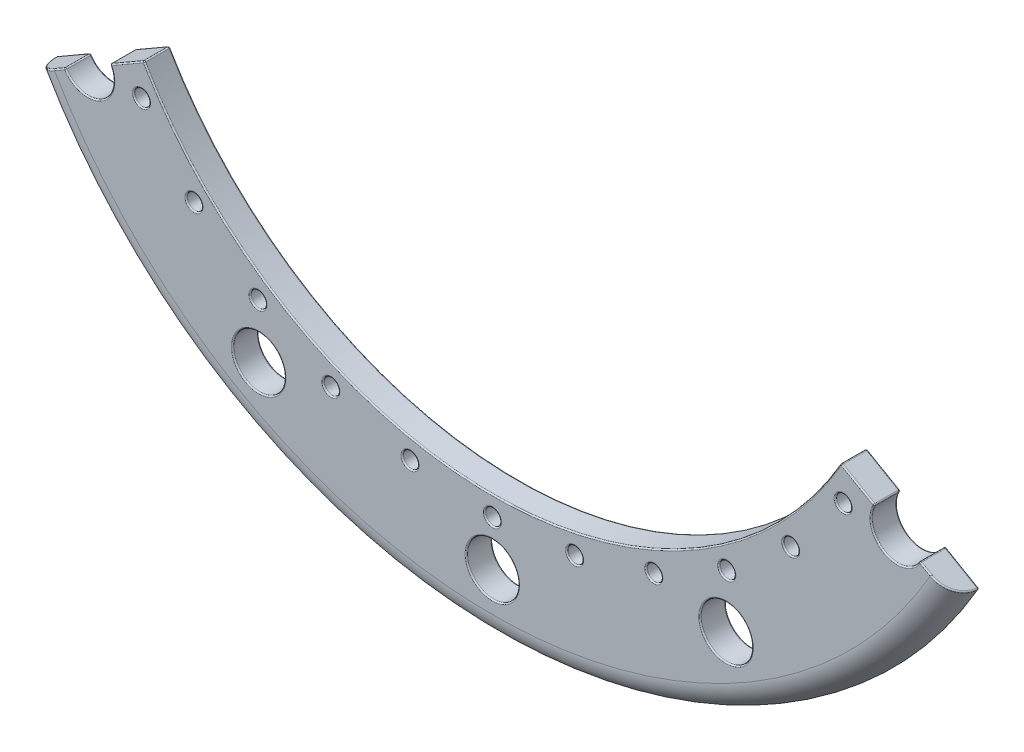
ISO-10303-21;
HEADER;
FILE_DESCRIPTION(('STEP AP214'),'2;1');
FILE_NAME('part.step','',(''),(''),'','','');
FILE_SCHEMA(('AUTOMOTIVE_DESIGN { 1 0 10303 214 1 1 1 1 }'));
ENDSEC;
DATA;
#1=APPLICATION_CONTEXT('core data for automotive mechanical design processes');
#2=APPLICATION_PROTOCOL_DEFINITION('international standard','automotive_design',2000,#1);
#3=PRODUCT_CONTEXT('',#1,'mechanical');
#4=PRODUCT('Part','Part','',(#3));
#5=PRODUCT_RELATED_PRODUCT_CATEGORY('part','',(#4));
#6=PRODUCT_DEFINITION_FORMATION('','',#4);
#7=PRODUCT_DEFINITION_CONTEXT('part definition',#1,'design');
#8=PRODUCT_DEFINITION('design','',#6,#7);
#9=PRODUCT_DEFINITION_SHAPE('','',#8);
#10=(LENGTH_UNIT() NAMED_UNIT(*) SI_UNIT(.MILLI.,.METRE.));
#11=(NAMED_UNIT(*) PLANE_ANGLE_UNIT() SI_UNIT($,.RADIAN.));
#12=(NAMED_UNIT(*) SI_UNIT($,.STERADIAN.) SOLID_ANGLE_UNIT());
#13=UNCERTAINTY_MEASURE_WITH_UNIT(LENGTH_MEASURE(1.E-05),#10,'distance_accuracy_value','');
#14=(GEOMETRIC_REPRESENTATION_CONTEXT(3) GLOBAL_UNCERTAINTY_ASSIGNED_CONTEXT((#13)) GLOBAL_UNIT_ASSIGNED_CONTEXT((#10,
#11,#12)) REPRESENTATION_CONTEXT('',''));
#15=CARTESIAN_POINT('',(0.,0.,0.));
#16=DIRECTION('',(0.,0.,1.));
#17=DIRECTION('',(1.,0.,0.));
#18=AXIS2_PLACEMENT_3D('',#15,#16,#17);
#19=CARTESIAN_POINT('',(-155.884572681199,-89.9999999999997,5.));
#20=DIRECTION('',(0.,0.,1.));
#21=DIRECTION('',(1.,0.,0.));
#22=AXIS2_PLACEMENT_3D('',#19,#20,#21);
#23=PLANE('',#22);
#24=CARTESIAN_POINT('',(-135.113811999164,-90.280162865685,5.));
#25=DIRECTION('',(0.,0.,1.));
#26=DIRECTION('',(1.,0.,0.));
#27=AXIS2_PLACEMENT_3D('',#24,#25,#26);
#28=CIRCLE('',#27,3.50000000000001);
#29=CARTESIAN_POINT('',(-131.613811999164,-90.280162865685,5.));
#30=VERTEX_POINT('',#29);
#31=EDGE_CURVE('E776',#30,#30,#28,.F.);
#32=ORIENTED_EDGE('',*,*,#31,.T.);
#33=EDGE_LOOP('',(#32));
#34=FACE_BOUND('',#33,.T.);
#35=CARTESIAN_POINT('',(-114.904851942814,-114.904851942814,5.));
#36=DIRECTION('',(0.,0.,1.));
#37=DIRECTION('',(1.,0.,0.));
#38=AXIS2_PLACEMENT_3D('',#35,#36,#37);
#39=CIRCLE('',#38,3.50000000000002);
#40=CARTESIAN_POINT('',(-111.404851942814,-114.904851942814,5.));
#41=VERTEX_POINT('',#40);
#42=EDGE_CURVE('E773',#41,#41,#39,.F.);
#43=ORIENTED_EDGE('',*,*,#42,.T.);
#44=EDGE_LOOP('',(#43));
#45=FACE_BOUND('',#44,.T.);
#46=CARTESIAN_POINT('',(-90.2801628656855,-135.113811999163,5.));
#47=DIRECTION('',(0.,0.,1.));
#48=DIRECTION('',(1.,0.,0.));
#49=AXIS2_PLACEMENT_3D('',#46,#47,#48);
#50=CIRCLE('',#49,3.5);
#51=CARTESIAN_POINT('',(-86.7801628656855,-135.113811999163,5.));
#52=VERTEX_POINT('',#51);
#53=EDGE_CURVE('E770',#52,#52,#50,.F.);
#54=ORIENTED_EDGE('',*,*,#53,.T.);
#55=EDGE_LOOP('',(#54));
#56=FACE_BOUND('',#55,.T.);
#57=CARTESIAN_POINT('',(-62.1860577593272,-150.130424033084,5.));
#58=DIRECTION('',(0.,0.,1.));
#59=DIRECTION('',(1.,0.,0.));
#60=AXIS2_PLACEMENT_3D('',#57,#58,#59);
#61=CIRCLE('',#60,3.5);
#62=CARTESIAN_POINT('',(-58.6860577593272,-150.130424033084,5.));
#63=VERTEX_POINT('',#62);
#64=EDGE_CURVE('E767',#63,#63,#61,.F.);
#65=ORIENTED_EDGE('',*,*,#64,.T.);
#66=EDGE_LOOP('',(#65));
#67=FACE_BOUND('',#66,.T.);
#68=CARTESIAN_POINT('',(-31.7021773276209,-159.377608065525,5.));
#69=DIRECTION('',(0.,0.,1.));
#70=DIRECTION('',(1.,0.,0.));
#71=AXIS2_PLACEMENT_3D('',#68,#69,#70);
#72=CIRCLE('',#71,3.49999999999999);
#73=CARTESIAN_POINT('',(-28.2021773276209,-159.377608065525,5.));
#74=VERTEX_POINT('',#73);
#75=EDGE_CURVE('E764',#74,#74,#72,.F.);
#76=ORIENTED_EDGE('',*,*,#75,.T.);
#77=EDGE_LOOP('',(#76));
#78=FACE_BOUND('',#77,.T.);
#79=CARTESIAN_POINT('',(0.,-162.5,5.));
#80=DIRECTION('',(0.,0.,1.));
#81=DIRECTION('',(1.,0.,0.));
#82=AXIS2_PLACEMENT_3D('',#79,#80,#81);
#83=CIRCLE('',#82,3.5);
#84=CARTESIAN_POINT('',(3.5,-162.5,5.));
#85=VERTEX_POINT('',#84);
#86=EDGE_CURVE('E761',#85,#85,#83,.F.);
#87=ORIENTED_EDGE('',*,*,#86,.T.);
#88=EDGE_LOOP('',(#87));
#89=FACE_BOUND('',#88,.T.);
#90=CARTESIAN_POINT('',(31.7021773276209,-159.377608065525,5.));
#91=DIRECTION('',(0.,0.,1.));
#92=DIRECTION('',(1.,0.,0.));
#93=AXIS2_PLACEMENT_3D('',#90,#91,#92);
#94=CIRCLE('',#93,3.50000000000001);
#95=CARTESIAN_POINT('',(35.2021773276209,-159.377608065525,5.));
#96=VERTEX_POINT('',#95);
#97=EDGE_CURVE('E758',#96,#96,#94,.F.);
#98=ORIENTED_EDGE('',*,*,#97,.T.);
#99=EDGE_LOOP('',(#98));
#100=FACE_BOUND('',#99,.T.);
#101=CARTESIAN_POINT('',(62.1860577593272,-150.130424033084,5.));
#102=DIRECTION('',(0.,0.,1.));
#103=DIRECTION('',(1.,0.,0.));
#104=AXIS2_PLACEMENT_3D('',#101,#102,#103);
#105=CIRCLE('',#104,3.5);
#106=CARTESIAN_POINT('',(65.6860577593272,-150.130424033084,5.));
#107=VERTEX_POINT('',#106);
#108=EDGE_CURVE('E755',#107,#107,#105,.F.);
#109=ORIENTED_EDGE('',*,*,#108,.T.);
#110=EDGE_LOOP('',(#109));
#111=FACE_BOUND('',#110,.T.);
#112=CARTESIAN_POINT('',(90.2801628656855,-135.113811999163,5.));
#113=DIRECTION('',(0.,0.,1.));
#114=DIRECTION('',(1.,0.,0.));
#115=AXIS2_PLACEMENT_3D('',#112,#113,#114);
#116=CIRCLE('',#115,3.50000000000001);
#117=CARTESIAN_POINT('',(93.7801628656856,-135.113811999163,5.));
#118=VERTEX_POINT('',#117);
#119=EDGE_CURVE('E752',#118,#118,#116,.F.);
#120=ORIENTED_EDGE('',*,*,#119,.T.);
#121=EDGE_LOOP('',(#120));
#122=FACE_BOUND('',#121,.T.);
#123=CARTESIAN_POINT('',(114.904851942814,-114.904851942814,5.));
#124=DIRECTION('',(0.,0.,1.));
#125=DIRECTION('',(1.,0.,0.));
#126=AXIS2_PLACEMENT_3D('',#123,#124,#125);
#127=CIRCLE('',#126,3.49999999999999);
#128=CARTESIAN_POINT('',(118.404851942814,-114.904851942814,5.));
#129=VERTEX_POINT('',#128);
#130=EDGE_CURVE('E749',#129,#129,#127,.F.);
#131=ORIENTED_EDGE('',*,*,#130,.T.);
#132=EDGE_LOOP('',(#131));
#133=FACE_BOUND('',#132,.T.);
#134=CARTESIAN_POINT('',(135.113811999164,-90.280162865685,5.));
#135=DIRECTION('',(0.,0.,1.));
#136=DIRECTION('',(1.,0.,0.));
#137=AXIS2_PLACEMENT_3D('',#134,#135,#136);
#138=CIRCLE('',#137,3.5);
#139=CARTESIAN_POINT('',(138.613811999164,-90.280162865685,5.));
#140=VERTEX_POINT('',#139);
#141=EDGE_CURVE('E741',#140,#140,#138,.F.);
#142=ORIENTED_EDGE('',*,*,#141,.T.);
#143=EDGE_LOOP('',(#142));
#144=FACE_BOUND('',#143,.T.);
#145=CARTESIAN_POINT('',(90.0000000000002,-155.884572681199,5.));
#146=DIRECTION('',(0.,0.,1.));
#147=DIRECTION('',(1.,0.,0.));
#148=AXIS2_PLACEMENT_3D('',#145,#146,#147);
#149=CIRCLE('',#148,10.5);
#150=CARTESIAN_POINT('',(100.5,-155.884572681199,5.));
#151=VERTEX_POINT('',#150);
#152=EDGE_CURVE('E737',#151,#151,#149,.F.);
#153=ORIENTED_EDGE('',*,*,#152,.T.);
#154=EDGE_LOOP('',(#153));
#155=FACE_BOUND('',#154,.T.);
#156=CARTESIAN_POINT('',(0.,-180.,5.));
#157=DIRECTION('',(0.,0.,1.));
#158=DIRECTION('',(1.,0.,0.));
#159=AXIS2_PLACEMENT_3D('',#156,#157,#158);
#160=CIRCLE('',#159,10.5);
#161=CARTESIAN_POINT('',(10.5,-180.,5.));
#162=VERTEX_POINT('',#161);
#163=EDGE_CURVE('E733',#162,#162,#160,.F.);
#164=ORIENTED_EDGE('',*,*,#163,.T.);
#165=EDGE_LOOP('',(#164));
#166=FACE_BOUND('',#165,.T.);
#167=CARTESIAN_POINT('',(-89.999999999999,-155.884572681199,5.));
#168=DIRECTION('',(0.,0.,1.));
#169=DIRECTION('',(1.,0.,0.));
#170=AXIS2_PLACEMENT_3D('',#167,#168,#169);
#171=CIRCLE('',#170,10.5);
#172=CARTESIAN_POINT('',(-79.499999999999,-155.884572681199,5.));
#173=VERTEX_POINT('',#172);
#174=EDGE_CURVE('E738',#173,#173,#171,.F.);
#175=ORIENTED_EDGE('',*,*,#174,.T.);
#176=EDGE_LOOP('',(#175));
#177=FACE_BOUND('',#176,.T.);
#178=CARTESIAN_POINT('',(0.,0.,5.));
#179=DIRECTION('',(0.,0.,1.));
#180=DIRECTION('',(1.,0.,0.));
#181=AXIS2_PLACEMENT_3D('',#178,#179,#180);
#182=CIRCLE('',#181,195.);
#183=CARTESIAN_POINT('',(-168.624398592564,-97.9326921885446,5.));
#184=VERTEX_POINT('',#183);
#185=CARTESIAN_POINT('',(168.624398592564,-97.9326921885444,5.));
#186=VERTEX_POINT('',#185);
#187=EDGE_CURVE('E193',#184,#186,#182,.T.);
#188=ORIENTED_EDGE('',*,*,#187,.T.);
#189=DIRECTION('',(-0.86602540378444,0.499999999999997,0.));
#190=VECTOR('',#189,1.);
#191=CARTESIAN_POINT('',(164.294826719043,-95.4330127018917,5.));
#192=LINE('',#191,#190);
#193=CARTESIAN_POINT('',(164.717523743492,-95.6770569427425,5.));
#194=VERTEX_POINT('',#193);
#195=EDGE_CURVE('E201',#186,#194,#192,.T.);
#196=ORIENTED_EDGE('',*,*,#195,.T.);
#197=CARTESIAN_POINT('',(155.884572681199,-89.9999999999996,5.));
#198=DIRECTION('',(0.,0.,1.));
#199=DIRECTION('',(1.,0.,0.));
#200=AXIS2_PLACEMENT_3D('',#197,#198,#199);
#201=CIRCLE('',#200,10.5);
#202=CARTESIAN_POINT('',(146.551621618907,-85.188968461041,5.));
#203=VERTEX_POINT('',#202);
#204=EDGE_CURVE('E202',#194,#203,#201,.F.);
#205=ORIENTED_EDGE('',*,*,#204,.T.);
#206=DIRECTION('',(-0.86602540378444,0.499999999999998,0.));
#207=VECTOR('',#206,1.);
#208=CARTESIAN_POINT('',(133.983937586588,-77.9330127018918,5.));
#209=LINE('',#208,#207);
#210=CARTESIAN_POINT('',(134.416254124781,-78.1826107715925,5.));
#211=VERTEX_POINT('',#210);
#212=EDGE_CURVE('E859',#203,#211,#209,.T.);
#213=ORIENTED_EDGE('',*,*,#212,.T.);
#214=CARTESIAN_POINT('',(0.,0.,5.));
#215=DIRECTION('',(0.,0.,1.));
#216=DIRECTION('',(1.,0.,0.));
#217=AXIS2_PLACEMENT_3D('',#214,#215,#216);
#218=CIRCLE('',#217,155.5);
#219=CARTESIAN_POINT('',(-134.416254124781,-78.1826107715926,5.));
#220=VERTEX_POINT('',#219);
#221=EDGE_CURVE('E211',#211,#220,#218,.F.);
#222=ORIENTED_EDGE('',*,*,#221,.T.);
#223=DIRECTION('',(-0.86602540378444,-0.499999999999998,0.));
#224=VECTOR('',#223,1.);
#225=CARTESIAN_POINT('',(-146.974318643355,-85.4330127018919,5.));
#226=LINE('',#225,#224);
#227=CARTESIAN_POINT('',(-146.551621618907,-85.1889684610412,5.));
#228=VERTEX_POINT('',#227);
#229=EDGE_CURVE('E862',#220,#228,#226,.T.);
#230=ORIENTED_EDGE('',*,*,#229,.T.);
#231=CARTESIAN_POINT('',(-155.884572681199,-89.9999999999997,5.));
#232=DIRECTION('',(0.,0.,1.));
#233=DIRECTION('',(1.,0.,0.));
#234=AXIS2_PLACEMENT_3D('',#231,#232,#233);
#235=CIRCLE('',#234,10.5);
#236=CARTESIAN_POINT('',(-164.717523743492,-95.6770569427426,5.));
#237=VERTEX_POINT('',#236);
#238=EDGE_CURVE('E196',#228,#237,#235,.F.);
#239=ORIENTED_EDGE('',*,*,#238,.T.);
#240=DIRECTION('',(-0.86602540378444,-0.499999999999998,0.));
#241=VECTOR('',#240,1.);
#242=CARTESIAN_POINT('',(-168.624953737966,-97.9330127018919,5.));
#243=LINE('',#242,#241);
#244=EDGE_CURVE('E191',#237,#184,#243,.T.);
#245=ORIENTED_EDGE('',*,*,#244,.T.);
#246=EDGE_LOOP('',(#188,#196,#205,#213,#222,#230,#239,#245));
#247=FACE_BOUND('',#246,.T.);
#248=ADVANCED_FACE('F31',(#34,#45,#56,#67,#78,#89,#100,#111,#122,#133,#144,#155,#166,#177,#247),
#23,.T.);
#249=CARTESIAN_POINT('',(-155.884572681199,-89.9999999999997,-5.));
#250=DIRECTION('',(0.,0.,1.));
#251=DIRECTION('',(1.,0.,0.));
#252=AXIS2_PLACEMENT_3D('',#249,#250,#251);
#253=PLANE('',#252);
#254=CARTESIAN_POINT('',(-135.113811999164,-90.280162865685,-5.));
#255=DIRECTION('',(0.,0.,1.));
#256=DIRECTION('',(1.,0.,0.));
#257=AXIS2_PLACEMENT_3D('',#254,#255,#256);
#258=CIRCLE('',#257,3.50000000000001);
#259=CARTESIAN_POINT('',(-131.613811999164,-90.280162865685,-5.));
#260=VERTEX_POINT('',#259);
#261=EDGE_CURVE('E601',#260,#260,#258,.T.);
#262=ORIENTED_EDGE('',*,*,#261,.T.);
#263=EDGE_LOOP('',(#262));
#264=FACE_BOUND('',#263,.T.);
#265=CARTESIAN_POINT('',(-114.904851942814,-114.904851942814,-5.));
#266=DIRECTION('',(0.,0.,1.));
#267=DIRECTION('',(1.,0.,0.));
#268=AXIS2_PLACEMENT_3D('',#265,#266,#267);
#269=CIRCLE('',#268,3.50000000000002);
#270=CARTESIAN_POINT('',(-111.404851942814,-114.904851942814,-5.));
#271=VERTEX_POINT('',#270);
#272=EDGE_CURVE('E598',#271,#271,#269,.T.);
#273=ORIENTED_EDGE('',*,*,#272,.T.);
#274=EDGE_LOOP('',(#273));
#275=FACE_BOUND('',#274,.T.);
#276=CARTESIAN_POINT('',(-90.2801628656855,-135.113811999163,-5.));
#277=DIRECTION('',(0.,0.,1.));
#278=DIRECTION('',(1.,0.,0.));
#279=AXIS2_PLACEMENT_3D('',#276,#277,#278);
#280=CIRCLE('',#279,3.5);
#281=CARTESIAN_POINT('',(-86.7801628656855,-135.113811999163,-5.));
#282=VERTEX_POINT('',#281);
#283=EDGE_CURVE('E595',#282,#282,#280,.T.);
#284=ORIENTED_EDGE('',*,*,#283,.T.);
#285=EDGE_LOOP('',(#284));
#286=FACE_BOUND('',#285,.T.);
#287=CARTESIAN_POINT('',(-62.1860577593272,-150.130424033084,-5.));
#288=DIRECTION('',(0.,0.,1.));
#289=DIRECTION('',(1.,0.,0.));
#290=AXIS2_PLACEMENT_3D('',#287,#288,#289);
#291=CIRCLE('',#290,3.5);
#292=CARTESIAN_POINT('',(-58.6860577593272,-150.130424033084,-5.));
#293=VERTEX_POINT('',#292);
#294=EDGE_CURVE('E592',#293,#293,#291,.T.);
#295=ORIENTED_EDGE('',*,*,#294,.T.);
#296=EDGE_LOOP('',(#295));
#297=FACE_BOUND('',#296,.T.);
#298=CARTESIAN_POINT('',(-31.7021773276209,-159.377608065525,-5.));
#299=DIRECTION('',(0.,0.,1.));
#300=DIRECTION('',(1.,0.,0.));
#301=AXIS2_PLACEMENT_3D('',#298,#299,#300);
#302=CIRCLE('',#301,3.49999999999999);
#303=CARTESIAN_POINT('',(-28.2021773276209,-159.377608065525,-5.));
#304=VERTEX_POINT('',#303);
#305=EDGE_CURVE('E589',#304,#304,#302,.T.);
#306=ORIENTED_EDGE('',*,*,#305,.T.);
#307=EDGE_LOOP('',(#306));
#308=FACE_BOUND('',#307,.T.);
#309=CARTESIAN_POINT('',(0.,-162.5,-5.));
#310=DIRECTION('',(0.,0.,1.));
#311=DIRECTION('',(1.,0.,0.));
#312=AXIS2_PLACEMENT_3D('',#309,#310,#311);
#313=CIRCLE('',#312,3.5);
#314=CARTESIAN_POINT('',(3.5,-162.5,-5.));
#315=VERTEX_POINT('',#314);
#316=EDGE_CURVE('E586',#315,#315,#313,.T.);
#317=ORIENTED_EDGE('',*,*,#316,.T.);
#318=EDGE_LOOP('',(#317));
#319=FACE_BOUND('',#318,.T.);
#320=CARTESIAN_POINT('',(31.7021773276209,-159.377608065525,-5.));
#321=DIRECTION('',(0.,0.,1.));
#322=DIRECTION('',(1.,0.,0.));
#323=AXIS2_PLACEMENT_3D('',#320,#321,#322);
#324=CIRCLE('',#323,3.50000000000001);
#325=CARTESIAN_POINT('',(35.2021773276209,-159.377608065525,-5.));
#326=VERTEX_POINT('',#325);
#327=EDGE_CURVE('E583',#326,#326,#324,.T.);
#328=ORIENTED_EDGE('',*,*,#327,.T.);
#329=EDGE_LOOP('',(#328));
#330=FACE_BOUND('',#329,.T.);
#331=CARTESIAN_POINT('',(62.1860577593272,-150.130424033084,-5.));
#332=DIRECTION('',(0.,0.,1.));
#333=DIRECTION('',(1.,0.,0.));
#334=AXIS2_PLACEMENT_3D('',#331,#332,#333);
#335=CIRCLE('',#334,3.5);
#336=CARTESIAN_POINT('',(65.6860577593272,-150.130424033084,-5.));
#337=VERTEX_POINT('',#336);
#338=EDGE_CURVE('E580',#337,#337,#335,.T.);
#339=ORIENTED_EDGE('',*,*,#338,.T.);
#340=EDGE_LOOP('',(#339));
#341=FACE_BOUND('',#340,.T.);
#342=CARTESIAN_POINT('',(90.2801628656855,-135.113811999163,-5.));
#343=DIRECTION('',(0.,0.,1.));
#344=DIRECTION('',(1.,0.,0.));
#345=AXIS2_PLACEMENT_3D('',#342,#343,#344);
#346=CIRCLE('',#345,3.50000000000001);
#347=CARTESIAN_POINT('',(93.7801628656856,-135.113811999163,-5.));
#348=VERTEX_POINT('',#347);
#349=EDGE_CURVE('E577',#348,#348,#346,.T.);
#350=ORIENTED_EDGE('',*,*,#349,.T.);
#351=EDGE_LOOP('',(#350));
#352=FACE_BOUND('',#351,.T.);
#353=CARTESIAN_POINT('',(114.904851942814,-114.904851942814,-5.));
#354=DIRECTION('',(0.,0.,1.));
#355=DIRECTION('',(1.,0.,0.));
#356=AXIS2_PLACEMENT_3D('',#353,#354,#355);
#357=CIRCLE('',#356,3.49999999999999);
#358=CARTESIAN_POINT('',(118.404851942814,-114.904851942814,-5.));
#359=VERTEX_POINT('',#358);
#360=EDGE_CURVE('E574',#359,#359,#357,.T.);
#361=ORIENTED_EDGE('',*,*,#360,.T.);
#362=EDGE_LOOP('',(#361));
#363=FACE_BOUND('',#362,.T.);
#364=CARTESIAN_POINT('',(135.113811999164,-90.280162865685,-5.));
#365=DIRECTION('',(0.,0.,1.));
#366=DIRECTION('',(1.,0.,0.));
#367=AXIS2_PLACEMENT_3D('',#364,#365,#366);
#368=CIRCLE('',#367,3.5);
#369=CARTESIAN_POINT('',(138.613811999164,-90.280162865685,-5.));
#370=VERTEX_POINT('',#369);
#371=EDGE_CURVE('E571',#370,#370,#368,.T.);
#372=ORIENTED_EDGE('',*,*,#371,.T.);
#373=EDGE_LOOP('',(#372));
#374=FACE_BOUND('',#373,.T.);
#375=CARTESIAN_POINT('',(90.0000000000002,-155.884572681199,-5.));
#376=DIRECTION('',(0.,0.,1.));
#377=DIRECTION('',(1.,0.,0.));
#378=AXIS2_PLACEMENT_3D('',#375,#376,#377);
#379=CIRCLE('',#378,10.5);
#380=CARTESIAN_POINT('',(100.5,-155.884572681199,-5.));
#381=VERTEX_POINT('',#380);
#382=EDGE_CURVE('E563',#381,#381,#379,.T.);
#383=ORIENTED_EDGE('',*,*,#382,.T.);
#384=EDGE_LOOP('',(#383));
#385=FACE_BOUND('',#384,.T.);
#386=CARTESIAN_POINT('',(0.,-180.,-5.));
#387=DIRECTION('',(0.,0.,1.));
#388=DIRECTION('',(1.,0.,0.));
#389=AXIS2_PLACEMENT_3D('',#386,#387,#388);
#390=CIRCLE('',#389,10.5);
#391=CARTESIAN_POINT('',(10.5,-180.,-5.));
#392=VERTEX_POINT('',#391);
#393=EDGE_CURVE('E559',#392,#392,#390,.T.);
#394=ORIENTED_EDGE('',*,*,#393,.T.);
#395=EDGE_LOOP('',(#394));
#396=FACE_BOUND('',#395,.T.);
#397=CARTESIAN_POINT('',(-89.999999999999,-155.884572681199,-5.));
#398=DIRECTION('',(0.,0.,1.));
#399=DIRECTION('',(1.,0.,0.));
#400=AXIS2_PLACEMENT_3D('',#397,#398,#399);
#401=CIRCLE('',#400,10.5);
#402=CARTESIAN_POINT('',(-79.499999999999,-155.884572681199,-5.));
#403=VERTEX_POINT('',#402);
#404=EDGE_CURVE('E557',#403,#403,#401,.T.);
#405=ORIENTED_EDGE('',*,*,#404,.T.);
#406=EDGE_LOOP('',(#405));
#407=FACE_BOUND('',#406,.T.);
#408=DIRECTION('',(-0.86602540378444,0.499999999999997,0.));
#409=VECTOR('',#408,1.);
#410=CARTESIAN_POINT('',(-78.1922863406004,44.5669872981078,-5.));
#411=LINE('',#410,#409);
#412=CARTESIAN_POINT('',(164.717523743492,-95.6770569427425,-5.));
#413=VERTEX_POINT('',#412);
#414=CARTESIAN_POINT('',(176.840262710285,-102.676123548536,-5.));
#415=VERTEX_POINT('',#414);
#416=EDGE_CURVE('E565',#413,#415,#411,.F.);
#417=ORIENTED_EDGE('',*,*,#416,.T.);
#418=CARTESIAN_POINT('',(0.,0.,-5.));
#419=DIRECTION('',(0.,0.,1.));
#420=DIRECTION('',(1.,0.,0.));
#421=AXIS2_PLACEMENT_3D('',#418,#419,#420);
#422=CIRCLE('',#421,204.486832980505);
#423=CARTESIAN_POINT('',(-176.840262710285,-102.676123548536,-5.));
#424=VERTEX_POINT('',#423);
#425=EDGE_CURVE('E560',#415,#424,#422,.F.);
#426=ORIENTED_EDGE('',*,*,#425,.T.);
#427=DIRECTION('',(-0.86602540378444,-0.499999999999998,0.));
#428=VECTOR('',#427,1.);
#429=CARTESIAN_POINT('',(-155.634572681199,-90.4330127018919,-5.));
#430=LINE('',#429,#428);
#431=CARTESIAN_POINT('',(-164.717523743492,-95.6770569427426,-5.));
#432=VERTEX_POINT('',#431);
#433=EDGE_CURVE('E808',#424,#432,#430,.F.);
#434=ORIENTED_EDGE('',*,*,#433,.T.);
#435=CARTESIAN_POINT('',(-155.884572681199,-89.9999999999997,-5.));
#436=DIRECTION('',(0.,0.,1.));
#437=DIRECTION('',(1.,0.,0.));
#438=AXIS2_PLACEMENT_3D('',#435,#436,#437);
#439=CIRCLE('',#438,10.5);
#440=CARTESIAN_POINT('',(-146.551621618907,-85.1889684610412,-5.));
#441=VERTEX_POINT('',#440);
#442=EDGE_CURVE('E804',#432,#441,#439,.T.);
#443=ORIENTED_EDGE('',*,*,#442,.T.);
#444=DIRECTION('',(-0.86602540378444,-0.499999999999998,0.));
#445=VECTOR('',#444,1.);
#446=CARTESIAN_POINT('',(-155.634572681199,-90.4330127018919,-5.));
#447=LINE('',#446,#445);
#448=CARTESIAN_POINT('',(-134.416254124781,-78.1826107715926,-5.));
#449=VERTEX_POINT('',#448);
#450=EDGE_CURVE('E799',#441,#449,#447,.F.);
#451=ORIENTED_EDGE('',*,*,#450,.T.);
#452=CARTESIAN_POINT('',(0.,0.,-5.));
#453=DIRECTION('',(0.,0.,1.));
#454=DIRECTION('',(1.,0.,0.));
#455=AXIS2_PLACEMENT_3D('',#452,#453,#454);
#456=CIRCLE('',#455,155.5);
#457=CARTESIAN_POINT('',(134.416254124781,-78.1826107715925,-5.));
#458=VERTEX_POINT('',#457);
#459=EDGE_CURVE('E797',#449,#458,#456,.T.);
#460=ORIENTED_EDGE('',*,*,#459,.T.);
#461=DIRECTION('',(-0.86602540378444,0.499999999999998,0.));
#462=VECTOR('',#461,1.);
#463=CARTESIAN_POINT('',(-78.1922863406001,44.566987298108,-5.));
#464=LINE('',#463,#462);
#465=CARTESIAN_POINT('',(146.551621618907,-85.188968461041,-5.));
#466=VERTEX_POINT('',#465);
#467=EDGE_CURVE('E801',#458,#466,#464,.F.);
#468=ORIENTED_EDGE('',*,*,#467,.T.);
#469=CARTESIAN_POINT('',(155.884572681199,-89.9999999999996,-5.));
#470=DIRECTION('',(0.,0.,1.));
#471=DIRECTION('',(1.,0.,0.));
#472=AXIS2_PLACEMENT_3D('',#469,#470,#471);
#473=CIRCLE('',#472,10.5);
#474=EDGE_CURVE('E806',#466,#413,#473,.T.);
#475=ORIENTED_EDGE('',*,*,#474,.T.);
#476=EDGE_LOOP('',(#417,#426,#434,#443,#451,#460,#468,#475));
#477=FACE_BOUND('',#476,.T.);
#478=ADVANCED_FACE('F636',(#264,#275,#286,#297,#308,#319,#330,#341,#352,#363,#374,#385,#396,
#407,#477),#253,.F.);
#479=CARTESIAN_POINT('',(-155.884572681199,-89.9999999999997,5.));
#480=DIRECTION('',(0.,0.,-1.));
#481=DIRECTION('',(-1.,0.,0.));
#482=AXIS2_PLACEMENT_3D('',#479,#480,#481);
#483=CYLINDRICAL_SURFACE('',#482,10.);
#484=CARTESIAN_POINT('',(-155.884572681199,-89.9999999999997,4.5));
#485=DIRECTION('',(0.,0.,1.));
#486=DIRECTION('',(1.,0.,0.));
#487=AXIS2_PLACEMENT_3D('',#484,#485,#486);
#488=CIRCLE('',#487,10.);
#489=CARTESIAN_POINT('',(-164.29690702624,-95.4067208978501,4.5));
#490=VERTEX_POINT('',#489);
#491=CARTESIAN_POINT('',(-146.996047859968,-85.4180652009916,4.5));
#492=VERTEX_POINT('',#491);
#493=EDGE_CURVE('E45',#490,#492,#488,.T.);
#494=ORIENTED_EDGE('',*,*,#493,.T.);
#495=DIRECTION('',(0.,0.,-1.));
#496=VECTOR('',#495,1.);
#497=CARTESIAN_POINT('',(-146.996047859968,-85.4180652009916,5.));
#498=LINE('',#497,#496);
#499=CARTESIAN_POINT('',(-146.996047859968,-85.4180652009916,-4.5));
#500=VERTEX_POINT('',#499);
#501=EDGE_CURVE('E11',#492,#500,#498,.T.);
#502=ORIENTED_EDGE('',*,*,#501,.T.);
#503=CARTESIAN_POINT('',(-155.884572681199,-89.9999999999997,-4.5));
#504=DIRECTION('',(0.,0.,1.));
#505=DIRECTION('',(1.,0.,0.));
#506=AXIS2_PLACEMENT_3D('',#503,#504,#505);
#507=CIRCLE('',#506,10.);
#508=CARTESIAN_POINT('',(-164.29690702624,-95.4067208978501,-4.5));
#509=VERTEX_POINT('',#508);
#510=EDGE_CURVE('E255',#500,#509,#507,.F.);
#511=ORIENTED_EDGE('',*,*,#510,.T.);
#512=DIRECTION('',(0.,0.,-1.));
#513=VECTOR('',#512,1.);
#514=CARTESIAN_POINT('',(-164.29690702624,-95.4067208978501,5.));
#515=LINE('',#514,#513);
#516=EDGE_CURVE('E56',#509,#490,#515,.F.);
#517=ORIENTED_EDGE('',*,*,#516,.T.);
#518=EDGE_LOOP('',(#494,#502,#511,#517));
#519=FACE_BOUND('',#518,.T.);
#520=ADVANCED_FACE('F421',(#519),#483,.F.);
#521=CARTESIAN_POINT('',(-177.53520777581,-102.5,5.));
#522=DIRECTION('',(0.499999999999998,-0.86602540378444,0.));
#523=DIRECTION('',(0.86602540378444,0.499999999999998,0.));
#524=AXIS2_PLACEMENT_3D('',#521,#522,#523);
#525=PLANE('',#524);
#526=CARTESIAN_POINT('',(-166.151119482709,-95.9273935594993,3.96447064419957));
#527=CARTESIAN_POINT('',(-166.007913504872,-95.8447135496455,4.43587823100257));
#528=CARTESIAN_POINT('',(-165.758005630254,-96.2772813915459,4.43628488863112));
#529=CARTESIAN_POINT('',(-166.369464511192,-96.05345512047,4.05293733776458));
#530=CARTESIAN_POINT('',(-166.237738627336,-95.9774031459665,4.52903354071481));
#531=CARTESIAN_POINT('',(-165.987824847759,-96.4100081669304,4.52940772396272));
#532=CARTESIAN_POINT('',(-166.591045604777,-96.181385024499,4.13071481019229));
#533=CARTESIAN_POINT('',(-166.470964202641,-96.1120559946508,4.61093466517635));
#534=CARTESIAN_POINT('',(-166.221050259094,-96.5447019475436,4.61127874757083));
#535=CARTESIAN_POINT('',(-167.039080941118,-96.4400583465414,4.26445358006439));
#536=CARTESIAN_POINT('',(-166.942549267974,-96.3843257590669,4.75177687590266));
#537=CARTESIAN_POINT('',(-166.692630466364,-96.8170515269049,4.75205640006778));
#538=CARTESIAN_POINT('',(-167.265534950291,-96.5708016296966,4.32041592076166));
#539=CARTESIAN_POINT('',(-167.180909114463,-96.5219428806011,4.81071748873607));
#540=CARTESIAN_POINT('',(-166.930985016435,-96.9547071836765,4.81096412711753));
#541=CARTESIAN_POINT('',(-167.721584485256,-96.8341019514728,4.4100649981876));
#542=CARTESIAN_POINT('',(-167.660940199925,-96.7990889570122,4.90515406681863));
#543=CARTESIAN_POINT('',(-167.411000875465,-97.2319278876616,4.90533157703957));
#544=CARTESIAN_POINT('',(-167.951177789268,-96.966657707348,4.44376673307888));
#545=CARTESIAN_POINT('',(-167.902609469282,-96.9386167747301,4.94066415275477));
#546=CARTESIAN_POINT('',(-167.652659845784,-97.3714915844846,4.94080708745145));
#547=CARTESIAN_POINT('',(-168.41194082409,-97.2326793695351,4.48874173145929));
#548=CARTESIAN_POINT('',(-168.387612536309,-97.2186334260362,4.98807783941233));
#549=CARTESIAN_POINT('',(-168.137637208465,-97.6515769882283,4.98814919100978));
#550=CARTESIAN_POINT('',(-168.643110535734,-97.3661452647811,4.50001526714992));
#551=CARTESIAN_POINT('',(-168.630946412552,-97.359122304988,4.9999800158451));
#552=CARTESIAN_POINT('',(-168.380955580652,-97.7920986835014,5.00001607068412));
#553=CARTESIAN_POINT('',(-169.336780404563,-97.7666357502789,4.49996947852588));
#554=CARTESIAN_POINT('',(-169.361151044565,-97.7807061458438,5.0000399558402));
#555=CARTESIAN_POINT('',(-169.11108010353,-98.2137610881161,4.9999678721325));
#556=CARTESIAN_POINT('',(-169.799635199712,-98.0338650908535,4.45482167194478));
#557=CARTESIAN_POINT('',(-169.848375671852,-98.0620054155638,4.95258081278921));
#558=CARTESIAN_POINT('',(-169.598259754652,-98.4951169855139,4.95244386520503));
#559=CARTESIAN_POINT('',(-170.711853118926,-98.5605343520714,4.27545995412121));
#560=CARTESIAN_POINT('',(-170.808645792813,-98.6164176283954,4.76391304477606));
#561=CARTESIAN_POINT('',(-170.55841890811,-99.0496266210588,4.7636420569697));
#562=CARTESIAN_POINT('',(-171.161219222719,-98.8199759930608,4.1412658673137));
#563=CARTESIAN_POINT('',(-171.281689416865,-98.8895294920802,4.62271276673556));
#564=CARTESIAN_POINT('',(-171.031401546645,-99.3227821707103,4.62238512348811));
#565=CARTESIAN_POINT('',(-172.034135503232,-99.3239544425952,3.78767546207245));
#566=CARTESIAN_POINT('',(-172.200624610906,-99.4200769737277,4.25062136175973));
#567=CARTESIAN_POINT('',(-171.950194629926,-99.853399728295,4.25018469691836));
#568=CARTESIAN_POINT('',(-172.457685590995,-99.5684911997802,3.56827885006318));
#569=CARTESIAN_POINT('',(-172.646508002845,-99.6775078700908,4.01971992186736));
#570=CARTESIAN_POINT('',(-172.396004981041,-100.110861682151,4.01924089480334));
#571=CARTESIAN_POINT('',(-173.266949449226,-100.035719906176,3.05044228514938));
#572=CARTESIAN_POINT('',(-173.498466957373,-100.169386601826,3.47470122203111));
#573=CARTESIAN_POINT('',(-173.247801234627,-100.602785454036,3.47414977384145));
#574=CARTESIAN_POINT('',(-173.652655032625,-100.258407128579,2.75198528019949));
#575=CARTESIAN_POINT('',(-173.904523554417,-100.403823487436,3.16055952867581));
#576=CARTESIAN_POINT('',(-173.653778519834,-100.837242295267,3.15998450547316));
#577=CARTESIAN_POINT('',(-174.375195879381,-100.675566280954,2.08453401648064));
#578=CARTESIAN_POINT('',(-174.665209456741,-100.843005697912,2.45800762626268));
#579=CARTESIAN_POINT('',(-174.414294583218,-101.276448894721,2.45740422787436));
#580=CARTESIAN_POINT('',(-174.712031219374,-100.870038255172,1.71553986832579));
#581=CARTESIAN_POINT('',(-175.019827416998,-101.047744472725,2.06959515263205));
#582=CARTESIAN_POINT('',(-174.768833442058,-101.481198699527,2.06898933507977));
#583=CARTESIAN_POINT('',(-175.327198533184,-101.225205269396,0.917550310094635));
#584=CARTESIAN_POINT('',(-175.667489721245,-101.421672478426,1.22958794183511));
#585=CARTESIAN_POINT('',(-175.416333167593,-101.855135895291,1.2290003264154));
#586=CARTESIAN_POINT('',(-175.605543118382,-101.385907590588,0.488567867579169));
#587=CARTESIAN_POINT('',(-175.960536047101,-101.590862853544,0.778008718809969));
#588=CARTESIAN_POINT('',(-175.709307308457,-102.024330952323,0.777439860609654));
#589=CARTESIAN_POINT('',(-176.095910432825,-101.669021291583,-0.417182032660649));
#590=CARTESIAN_POINT('',(-176.476818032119,-101.888938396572,-0.175474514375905));
#591=CARTESIAN_POINT('',(-176.225448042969,-102.322406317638,-0.175981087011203));
#592=CARTESIAN_POINT('',(-176.307933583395,-101.791432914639,-0.893949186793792));
#593=CARTESIAN_POINT('',(-176.700044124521,-102.017818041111,-0.677372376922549));
#594=CARTESIAN_POINT('',(-176.448615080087,-102.45128688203,-0.677841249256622));
#595=CARTESIAN_POINT('',(-176.65972165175,-101.994537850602,-1.88221834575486));
#596=CARTESIAN_POINT('',(-177.070429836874,-102.231660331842,-1.71775486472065));
#597=CARTESIAN_POINT('',(-176.818893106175,-102.665124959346,-1.71812457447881));
#598=CARTESIAN_POINT('',(-176.799470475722,-102.075221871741,-2.39372805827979));
#599=CARTESIAN_POINT('',(-177.217564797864,-102.316608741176,-2.25623852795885));
#600=CARTESIAN_POINT('',(-176.965987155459,-102.750072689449,-2.25655585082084));
#601=CARTESIAN_POINT('',(-176.951779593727,-102.163157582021,-3.17515792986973));
#602=CARTESIAN_POINT('',(-177.377926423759,-102.409193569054,-3.0788841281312));
#603=CARTESIAN_POINT('',(-177.12630168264,-102.842655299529,-3.0791136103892));
#604=CARTESIAN_POINT('',(-176.992999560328,-102.186955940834,-3.43805171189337));
#605=CARTESIAN_POINT('',(-177.421325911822,-102.434250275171,-3.35564609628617));
#606=CARTESIAN_POINT('',(-177.169688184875,-102.867711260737,-3.35584390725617));
#607=CARTESIAN_POINT('',(-177.056144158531,-102.223412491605,-3.96698667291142));
#608=CARTESIAN_POINT('',(-177.487809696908,-102.472634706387,-3.91248611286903));
#609=CARTESIAN_POINT('',(-177.236151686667,-102.906094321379,-3.91261755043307));
#610=CARTESIAN_POINT('',(-177.078068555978,-102.236070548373,-4.23302789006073));
#611=CARTESIAN_POINT('',(-177.510893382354,-102.485962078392,-4.19256270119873));
#612=CARTESIAN_POINT('',(-177.259228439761,-102.91942127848,-4.19266093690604));
#613=CARTESIAN_POINT('',(-177.102433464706,-102.250137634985,-4.76645955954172));
#614=CARTESIAN_POINT('',(-177.53654680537,-102.500773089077,-4.75413827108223));
#615=CARTESIAN_POINT('',(-177.284873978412,-102.934231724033,-4.75416795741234));
#616=CARTESIAN_POINT('',(-177.104860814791,-102.25153906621,-5.03385080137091));
#617=CARTESIAN_POINT('',(-177.539102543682,-102.502248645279,-5.03563653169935));
#618=CARTESIAN_POINT('',(-177.287428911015,-102.935707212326,-5.0356324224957));
#619=CARTESIAN_POINT('',(-177.090215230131,-102.243083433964,-5.5679325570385));
#620=CARTESIAN_POINT('',(-177.523682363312,-102.493345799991,-5.59789664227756));
#621=CARTESIAN_POINT('',(-177.272013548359,-102.926804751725,-5.59782374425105));
#622=CARTESIAN_POINT('',(-177.073141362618,-102.233225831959,-5.83462303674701));
#623=CARTESIAN_POINT('',(-177.505705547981,-102.482966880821,-5.87865690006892));
#624=CARTESIAN_POINT('',(-177.254042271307,-102.91642623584,-5.87855056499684));
#625=CARTESIAN_POINT('',(-177.046325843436,-102.217743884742,-6.10001442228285));
#626=CARTESIAN_POINT('',(-177.477472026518,-102.466666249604,-6.15805090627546));
#627=CARTESIAN_POINT('',(-177.22581731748,-102.900126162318,-6.15790991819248));
#628=(BOUNDED_SURFACE() B_SPLINE_SURFACE(3,2,((#526,#527,#528),(#529,#530,#531),(#532,#533,
#534),(#535,#536,#537),(#538,#539,#540),(#541,#542,#543),(#544,#545,#546),(#547,#548,#549),
(#550,#551,#552),(#553,#554,#555),(#556,#557,#558),(#559,#560,#561),(#562,#563,#564),(#565,#566,
#567),(#568,#569,#570),(#571,#572,#573),(#574,#575,#576),(#577,#578,#579),(#580,#581,#582),
(#583,#584,#585),(#586,#587,#588),(#589,#590,#591),(#592,#593,#594),(#595,#596,#597),(#598,#599,
#600),(#601,#602,#603),(#604,#605,#606),(#607,#608,#609),(#610,#611,#612),(#613,#614,#615),
(#616,#617,#618),(#619,#620,#621),(#622,#623,#624),(#625,#626,#627)),.UNSPECIFIED.,.F.,.F.,
.F.) B_SPLINE_SURFACE_WITH_KNOTS((4,2,2,2,2,2,2,2,2,2,2,2,2,2,2,2,4),(3,3),(0.,
0.801320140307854,1.60260195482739,2.40334335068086,3.20407502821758,4.80486570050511,
6.40530010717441,8.00574002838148,9.60652541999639,11.2073083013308,12.8077456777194,
14.4081728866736,16.0089563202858,16.8096819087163,17.6104172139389,18.4116929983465,
19.2130071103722),(0.,1.),
.UNSPECIFIED.) GEOMETRIC_REPRESENTATION_ITEM() RATIONAL_B_SPLINE_SURFACE(((1.,0.707411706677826,
1.),(1.,0.707386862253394,1.),(1.,0.707361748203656,1.),(1.,0.7073111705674,1.),(1.,
0.707285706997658,1.),(1.,0.707234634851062,1.),(1.,0.70720902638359,1.),(1.,0.707157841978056,
1.),(1.,0.707132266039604,1.),(1.,0.70705583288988,1.),(1.,0.70700524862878,1.),(1.,
0.706906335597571,1.),(1.,0.706858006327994,1.),(1.,0.706764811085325,1.),(1.,0.706719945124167,
1.),(1.,0.706634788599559,1.),(1.,0.706594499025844,1.),(1.,0.706519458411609,1.),(1.,
0.706484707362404,1.),(1.,0.706421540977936,1.),(1.,0.706393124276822,1.),(1.,0.706343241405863,
1.),(1.,0.706321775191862,1.),(1.,0.706286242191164,1.),(1.,0.706272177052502,1.),(1.,
0.706256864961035,1.),(1.,0.706252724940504,1.),(1.,0.706246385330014,1.),(1.,0.706244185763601,
1.),(1.,0.706241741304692,1.),(1.,0.706241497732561,1.),(1.,0.706242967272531,1.),(1.,
0.706244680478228,1.),(1.,0.706247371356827,1.))) REPRESENTATION_ITEM('') SURFACE());
#629=CARTESIAN_POINT('',(-177.046325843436,-102.217743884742,-6.10001442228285));
#630=CARTESIAN_POINT('',(-177.073141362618,-102.233225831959,-5.83462303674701));
#631=CARTESIAN_POINT('',(-177.090215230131,-102.243083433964,-5.5679325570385));
#632=CARTESIAN_POINT('',(-177.104860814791,-102.25153906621,-5.03385080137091));
#633=CARTESIAN_POINT('',(-177.102433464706,-102.250137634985,-4.76645955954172));
#634=CARTESIAN_POINT('',(-177.078068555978,-102.236070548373,-4.23302789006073));
#635=CARTESIAN_POINT('',(-177.056144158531,-102.223412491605,-3.96698667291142));
#636=CARTESIAN_POINT('',(-176.992999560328,-102.186955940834,-3.43805171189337));
#637=CARTESIAN_POINT('',(-176.951779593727,-102.163157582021,-3.17515792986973));
#638=CARTESIAN_POINT('',(-176.799470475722,-102.075221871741,-2.39372805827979));
#639=CARTESIAN_POINT('',(-176.65972165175,-101.994537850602,-1.88221834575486));
#640=CARTESIAN_POINT('',(-176.307933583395,-101.791432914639,-0.893949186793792));
#641=CARTESIAN_POINT('',(-176.095910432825,-101.669021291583,-0.417182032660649));
#642=CARTESIAN_POINT('',(-175.605543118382,-101.385907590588,0.488567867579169));
#643=CARTESIAN_POINT('',(-175.327198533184,-101.225205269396,0.917550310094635));
#644=CARTESIAN_POINT('',(-174.712031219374,-100.870038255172,1.71553986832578));
#645=CARTESIAN_POINT('',(-174.375195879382,-100.675566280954,2.08453401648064));
#646=CARTESIAN_POINT('',(-173.652655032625,-100.258407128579,2.75198528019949));
#647=CARTESIAN_POINT('',(-173.266949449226,-100.035719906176,3.05044228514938));
#648=CARTESIAN_POINT('',(-172.457685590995,-99.5684911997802,3.56827885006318));
#649=CARTESIAN_POINT('',(-172.034135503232,-99.3239544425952,3.78767546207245));
#650=CARTESIAN_POINT('',(-171.161219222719,-98.8199759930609,4.1412658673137));
#651=CARTESIAN_POINT('',(-170.711853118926,-98.5605343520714,4.27545995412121));
#652=CARTESIAN_POINT('',(-169.799635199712,-98.0338650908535,4.45482167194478));
#653=CARTESIAN_POINT('',(-169.336780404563,-97.7666357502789,4.49996947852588));
#654=CARTESIAN_POINT('',(-168.643110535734,-97.3661452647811,4.50001526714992));
#655=CARTESIAN_POINT('',(-168.41194082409,-97.2326793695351,4.48874173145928));
#656=CARTESIAN_POINT('',(-167.951177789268,-96.966657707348,4.44376673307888));
#657=CARTESIAN_POINT('',(-167.721584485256,-96.8341019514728,4.4100649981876));
#658=CARTESIAN_POINT('',(-167.265534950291,-96.5708016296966,4.32041592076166));
#659=CARTESIAN_POINT('',(-167.039080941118,-96.4400583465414,4.26445358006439));
#660=CARTESIAN_POINT('',(-166.591045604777,-96.181385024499,4.13071481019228));
#661=CARTESIAN_POINT('',(-166.369464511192,-96.05345512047,4.05293733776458));
#662=CARTESIAN_POINT('',(-166.151119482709,-95.9273935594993,3.96447064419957));
#663=B_SPLINE_CURVE_WITH_KNOTS('',3,(#629,#630,#631,#632,#633,#634,#635,#636,#637,#638,#639,
#640,#641,#642,#643,#644,#645,#646,#647,#648,#649,#650,#651,#652,#653,#654,#655,#656,#657,#658,
#659,#660,#661,#662),.UNSPECIFIED.,.F.,.F.,(4,2,2,2,2,2,2,2,2,2,2,2,2,2,2,2,4),(0.,
0.801314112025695,1.60258989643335,2.40332520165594,3.20405079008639,4.80483422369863,
6.40526143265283,8.00569880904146,9.60648169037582,11.2072670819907,12.8077070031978,
14.4081414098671,16.0089320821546,16.8096637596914,17.6104051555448,18.4116869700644,
19.2130071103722),.UNSPECIFIED.);
#664=CARTESIAN_POINT('',(-177.090262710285,-102.243110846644,-4.5));
#665=VERTEX_POINT('',#664);
#666=CARTESIAN_POINT('',(-168.874398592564,-97.4996794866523,4.5));
#667=VERTEX_POINT('',#666);
#668=EDGE_CURVE('E447',#665,#667,#663,.T.);
#669=ORIENTED_EDGE('',*,*,#668,.T.);
#670=DIRECTION('',(-0.86602540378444,-0.499999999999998,0.));
#671=VECTOR('',#670,1.);
#672=CARTESIAN_POINT('',(-164.544826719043,-94.9999999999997,4.5));
#673=LINE('',#672,#671);
#674=CARTESIAN_POINT('',(-164.967523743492,-95.2440442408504,4.5));
#675=VERTEX_POINT('',#674);
#676=EDGE_CURVE('E227',#667,#675,#673,.F.);
#677=ORIENTED_EDGE('',*,*,#676,.T.);
#678=DIRECTION('',(0.,0.,-1.));
#679=VECTOR('',#678,1.);
#680=CARTESIAN_POINT('',(-164.967523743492,-95.2440442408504,5.));
#681=LINE('',#680,#679);
#682=CARTESIAN_POINT('',(-164.967523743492,-95.2440442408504,-4.5));
#683=VERTEX_POINT('',#682);
#684=EDGE_CURVE('E252',#675,#683,#681,.T.);
#685=ORIENTED_EDGE('',*,*,#684,.T.);
#686=DIRECTION('',(-0.86602540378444,-0.499999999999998,0.));
#687=VECTOR('',#686,1.);
#688=CARTESIAN_POINT('',(-177.53520777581,-102.5,-4.5));
#689=LINE('',#688,#687);
#690=EDGE_CURVE('E453',#683,#665,#689,.T.);
#691=ORIENTED_EDGE('',*,*,#690,.T.);
#692=EDGE_LOOP('',(#669,#677,#685,#691));
#693=FACE_BOUND('',#692,.T.);
#694=ADVANCED_FACE('F413',(#693),#525,.F.);
#695=CARTESIAN_POINT('',(177.53520777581,-102.5,5.));
#696=DIRECTION('',(-0.499999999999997,-0.86602540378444,0.));
#697=DIRECTION('',(0.86602540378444,-0.499999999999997,0.));
#698=AXIS2_PLACEMENT_3D('',#695,#696,#697);
#699=PLANE('',#698);
#700=CARTESIAN_POINT('',(165.758005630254,-96.2772813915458,4.43628488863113));
#701=CARTESIAN_POINT('',(166.007913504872,-95.8447135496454,4.43587823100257));
#702=CARTESIAN_POINT('',(166.151119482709,-95.9273935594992,3.96447064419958));
#703=CARTESIAN_POINT('',(165.987824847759,-96.4100081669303,4.52940772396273));
#704=CARTESIAN_POINT('',(166.237738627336,-95.9774031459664,4.52903354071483));
#705=CARTESIAN_POINT('',(166.369464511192,-96.0534551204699,4.0529373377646));
#706=CARTESIAN_POINT('',(166.221050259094,-96.5447019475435,4.61127874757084));
#707=CARTESIAN_POINT('',(166.470964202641,-96.1120559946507,4.61093466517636));
#708=CARTESIAN_POINT('',(166.591045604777,-96.1813850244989,4.1307148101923));
#709=CARTESIAN_POINT('',(166.692630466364,-96.8170515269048,4.75205640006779));
#710=CARTESIAN_POINT('',(166.942549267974,-96.3843257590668,4.75177687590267));
#711=CARTESIAN_POINT('',(167.039080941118,-96.4400583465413,4.2644535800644));
#712=CARTESIAN_POINT('',(166.930985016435,-96.9547071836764,4.81096412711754));
#713=CARTESIAN_POINT('',(167.180909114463,-96.521942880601,4.81071748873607));
#714=CARTESIAN_POINT('',(167.265534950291,-96.5708016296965,4.32041592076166));
#715=CARTESIAN_POINT('',(167.411000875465,-97.2319278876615,4.90533157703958));
#716=CARTESIAN_POINT('',(167.660940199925,-96.7990889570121,4.90515406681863));
#717=CARTESIAN_POINT('',(167.721584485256,-96.8341019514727,4.4100649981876));
#718=CARTESIAN_POINT('',(167.652659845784,-97.3714915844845,4.94080708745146));
#719=CARTESIAN_POINT('',(167.902609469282,-96.9386167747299,4.94066415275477));
#720=CARTESIAN_POINT('',(167.951177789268,-96.9666577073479,4.44376673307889));
#721=CARTESIAN_POINT('',(168.137637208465,-97.6515769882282,4.98814919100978));
#722=CARTESIAN_POINT('',(168.38761253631,-97.218633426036,4.98807783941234));
#723=CARTESIAN_POINT('',(168.41194082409,-97.2326793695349,4.48874173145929));
#724=CARTESIAN_POINT('',(168.380955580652,-97.7920986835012,5.00001607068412));
#725=CARTESIAN_POINT('',(168.630946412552,-97.3591223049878,4.9999800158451));
#726=CARTESIAN_POINT('',(168.643110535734,-97.366145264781,4.50001526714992));
#727=CARTESIAN_POINT('',(169.11108010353,-98.213761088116,4.9999678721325));
#728=CARTESIAN_POINT('',(169.361151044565,-97.7807061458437,5.00003995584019));
#729=CARTESIAN_POINT('',(169.336780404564,-97.7666357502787,4.49996947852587));
#730=CARTESIAN_POINT('',(169.598259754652,-98.4951169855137,4.95244386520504));
#731=CARTESIAN_POINT('',(169.848375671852,-98.0620054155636,4.9525808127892));
#732=CARTESIAN_POINT('',(169.799635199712,-98.0338650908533,4.45482167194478));
#733=CARTESIAN_POINT('',(170.55841890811,-99.0496266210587,4.76364205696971));
#734=CARTESIAN_POINT('',(170.808645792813,-98.6164176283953,4.76391304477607));
#735=CARTESIAN_POINT('',(170.711853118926,-98.5605343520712,4.27545995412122));
#736=CARTESIAN_POINT('',(171.031401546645,-99.3227821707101,4.62238512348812));
#737=CARTESIAN_POINT('',(171.281689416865,-98.8895294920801,4.62271276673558));
#738=CARTESIAN_POINT('',(171.161219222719,-98.8199759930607,4.14126586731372));
#739=CARTESIAN_POINT('',(171.950194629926,-99.8533997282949,4.25018469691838));
#740=CARTESIAN_POINT('',(172.200624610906,-99.4200769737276,4.25062136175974));
#741=CARTESIAN_POINT('',(172.034135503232,-99.3239544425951,3.78767546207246));
#742=CARTESIAN_POINT('',(172.396004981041,-100.110861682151,4.01924089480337));
#743=CARTESIAN_POINT('',(172.646508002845,-99.6775078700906,4.01971992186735));
#744=CARTESIAN_POINT('',(172.457685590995,-99.56849119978,3.56827885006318));
#745=CARTESIAN_POINT('',(173.247801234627,-100.602785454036,3.47414977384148));
#746=CARTESIAN_POINT('',(173.498466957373,-100.169386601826,3.47470122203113));
#747=CARTESIAN_POINT('',(173.266949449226,-100.035719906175,3.05044228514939));
#748=CARTESIAN_POINT('',(173.653778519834,-100.837242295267,3.15998450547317));
#749=CARTESIAN_POINT('',(173.904523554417,-100.403823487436,3.16055952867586));
#750=CARTESIAN_POINT('',(173.652655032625,-100.258407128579,2.75198528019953));
#751=CARTESIAN_POINT('',(174.414294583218,-101.276448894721,2.4574042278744));
#752=CARTESIAN_POINT('',(174.665209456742,-100.843005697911,2.45800762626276));
#753=CARTESIAN_POINT('',(174.375195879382,-100.675566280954,2.0845340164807));
#754=CARTESIAN_POINT('',(174.768833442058,-101.481198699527,2.06898933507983));
#755=CARTESIAN_POINT('',(175.019827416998,-101.047744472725,2.06959515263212));
#756=CARTESIAN_POINT('',(174.712031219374,-100.870038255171,1.71553986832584));
#757=CARTESIAN_POINT('',(175.416333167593,-101.855135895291,1.2290003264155));
#758=CARTESIAN_POINT('',(175.667489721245,-101.421672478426,1.2295879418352));
#759=CARTESIAN_POINT('',(175.327198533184,-101.225205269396,0.917550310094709));
#760=CARTESIAN_POINT('',(175.709307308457,-102.024330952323,0.777439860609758));
#761=CARTESIAN_POINT('',(175.960536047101,-101.590862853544,0.77800871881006));
#762=CARTESIAN_POINT('',(175.605543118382,-101.385907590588,0.488567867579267));
#763=CARTESIAN_POINT('',(176.225448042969,-102.322406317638,-0.175981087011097));
#764=CARTESIAN_POINT('',(176.476818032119,-101.888938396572,-0.175474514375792));
#765=CARTESIAN_POINT('',(176.095910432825,-101.669021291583,-0.417182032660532));
#766=CARTESIAN_POINT('',(176.448615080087,-102.45128688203,-0.67784124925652));
#767=CARTESIAN_POINT('',(176.700044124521,-102.017818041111,-0.677372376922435));
#768=CARTESIAN_POINT('',(176.307933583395,-101.791432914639,-0.893949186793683));
#769=CARTESIAN_POINT('',(176.818893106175,-102.665124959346,-1.71812457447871));
#770=CARTESIAN_POINT('',(177.070429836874,-102.231660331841,-1.71775486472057));
#771=CARTESIAN_POINT('',(176.65972165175,-101.994537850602,-1.88221834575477));
#772=CARTESIAN_POINT('',(176.965987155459,-102.750072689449,-2.25655585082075));
#773=CARTESIAN_POINT('',(177.217564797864,-102.316608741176,-2.25623852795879));
#774=CARTESIAN_POINT('',(176.799470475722,-102.075221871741,-2.39372805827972));
#775=CARTESIAN_POINT('',(177.12630168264,-102.842655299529,-3.07911361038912));
#776=CARTESIAN_POINT('',(177.377926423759,-102.409193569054,-3.07888412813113));
#777=CARTESIAN_POINT('',(176.951779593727,-102.163157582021,-3.17515792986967));
#778=CARTESIAN_POINT('',(177.169688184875,-102.867711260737,-3.3558439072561));
#779=CARTESIAN_POINT('',(177.421325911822,-102.43425027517,-3.3556460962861));
#780=CARTESIAN_POINT('',(176.992999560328,-102.186955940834,-3.4380517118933));
#781=CARTESIAN_POINT('',(177.236151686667,-102.906094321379,-3.912617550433));
#782=CARTESIAN_POINT('',(177.487809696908,-102.472634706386,-3.91248611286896));
#783=CARTESIAN_POINT('',(177.056144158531,-102.223412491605,-3.96698667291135));
#784=CARTESIAN_POINT('',(177.259228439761,-102.91942127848,-4.19266093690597));
#785=CARTESIAN_POINT('',(177.510893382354,-102.485962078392,-4.19256270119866));
#786=CARTESIAN_POINT('',(177.078068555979,-102.236070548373,-4.23302789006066));
#787=CARTESIAN_POINT('',(177.284873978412,-102.934231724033,-4.75416795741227));
#788=CARTESIAN_POINT('',(177.53654680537,-102.500773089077,-4.75413827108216));
#789=CARTESIAN_POINT('',(177.102433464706,-102.250137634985,-4.76645955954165));
#790=CARTESIAN_POINT('',(177.287428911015,-102.935707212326,-5.03563242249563));
#791=CARTESIAN_POINT('',(177.539102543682,-102.502248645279,-5.03563653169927));
#792=CARTESIAN_POINT('',(177.104860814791,-102.25153906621,-5.03385080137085));
#793=CARTESIAN_POINT('',(177.27201354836,-102.926804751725,-5.59782374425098));
#794=CARTESIAN_POINT('',(177.523682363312,-102.493345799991,-5.59789664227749));
#795=CARTESIAN_POINT('',(177.090215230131,-102.243083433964,-5.56793255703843));
#796=CARTESIAN_POINT('',(177.254042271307,-102.916426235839,-5.87855056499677));
#797=CARTESIAN_POINT('',(177.505705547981,-102.482966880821,-5.87865690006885));
#798=CARTESIAN_POINT('',(177.073141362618,-102.233225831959,-5.83462303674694));
#799=CARTESIAN_POINT('',(177.22581731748,-102.900126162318,-6.1579099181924));
#800=CARTESIAN_POINT('',(177.477472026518,-102.466666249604,-6.15805090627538));
#801=CARTESIAN_POINT('',(177.046325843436,-102.217743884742,-6.10001442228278));
#802=(BOUNDED_SURFACE() B_SPLINE_SURFACE(3,2,((#700,#701,#702),(#703,#704,#705),(#706,#707,
#708),(#709,#710,#711),(#712,#713,#714),(#715,#716,#717),(#718,#719,#720),(#721,#722,#723),
(#724,#725,#726),(#727,#728,#729),(#730,#731,#732),(#733,#734,#735),(#736,#737,#738),(#739,#740,
#741),(#742,#743,#744),(#745,#746,#747),(#748,#749,#750),(#751,#752,#753),(#754,#755,#756),
(#757,#758,#759),(#760,#761,#762),(#763,#764,#765),(#766,#767,#768),(#769,#770,#771),(#772,#773,
#774),(#775,#776,#777),(#778,#779,#780),(#781,#782,#783),(#784,#785,#786),(#787,#788,#789),
(#790,#791,#792),(#793,#794,#795),(#796,#797,#798),(#799,#800,#801)),.UNSPECIFIED.,.F.,.F.,
.F.) B_SPLINE_SURFACE_WITH_KNOTS((4,2,2,2,2,2,2,2,2,2,2,2,2,2,2,2,4),(3,3),(0.,
0.801320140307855,1.60260195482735,2.40334335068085,3.20407502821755,4.80486570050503,
6.40530010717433,8.00574002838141,9.60652541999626,11.2073083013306,12.8077456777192,
14.4081728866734,16.0089563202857,16.8096819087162,17.6104172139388,18.4116929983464,
19.2130071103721),(0.,1.),
.UNSPECIFIED.) GEOMETRIC_REPRESENTATION_ITEM() RATIONAL_B_SPLINE_SURFACE(((1.,0.707411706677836,
1.),(1.,0.707386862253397,1.),(1.,0.707361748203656,1.),(1.,0.7073111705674,1.),(1.,
0.707285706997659,1.),(1.,0.707234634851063,1.),(1.,0.707209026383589,1.),(1.,0.707157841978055,
1.),(1.,0.707132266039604,1.),(1.,0.707055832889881,1.),(1.,0.70700524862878,1.),(1.,
0.70690633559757,1.),(1.,0.706858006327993,1.),(1.,0.706764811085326,1.),(1.,0.706719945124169,
1.),(1.,0.706634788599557,1.),(1.,0.706594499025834,1.),(1.,0.706519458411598,1.),(1.,
0.706484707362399,1.),(1.,0.70642154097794,1.),(1.,0.706393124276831,1.),(1.,0.706343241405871,
1.),(1.,0.706321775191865,1.),(1.,0.706286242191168,1.),(1.,0.706272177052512,1.),(1.,
0.706256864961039,1.),(1.,0.706252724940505,1.),(1.,0.706246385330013,1.),(1.,0.706244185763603,
1.),(1.,0.706241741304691,1.),(1.,0.706241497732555,1.),(1.,0.706242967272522,1.),(1.,
0.706244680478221,1.),(1.,0.706247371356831,1.))) REPRESENTATION_ITEM('') SURFACE());
#803=CARTESIAN_POINT('',(166.151119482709,-95.9273935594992,3.96447064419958));
#804=CARTESIAN_POINT('',(166.369464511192,-96.0534551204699,4.0529373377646));
#805=CARTESIAN_POINT('',(166.591045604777,-96.1813850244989,4.1307148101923));
#806=CARTESIAN_POINT('',(167.039080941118,-96.4400583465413,4.2644535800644));
#807=CARTESIAN_POINT('',(167.265534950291,-96.5708016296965,4.32041592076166));
#808=CARTESIAN_POINT('',(167.721584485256,-96.8341019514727,4.4100649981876));
#809=CARTESIAN_POINT('',(167.951177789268,-96.9666577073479,4.44376673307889));
#810=CARTESIAN_POINT('',(168.41194082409,-97.2326793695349,4.48874173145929));
#811=CARTESIAN_POINT('',(168.643110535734,-97.366145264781,4.50001526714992));
#812=CARTESIAN_POINT('',(169.336780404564,-97.7666357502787,4.49996947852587));
#813=CARTESIAN_POINT('',(169.799635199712,-98.0338650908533,4.45482167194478));
#814=CARTESIAN_POINT('',(170.711853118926,-98.5605343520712,4.27545995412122));
#815=CARTESIAN_POINT('',(171.161219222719,-98.8199759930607,4.14126586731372));
#816=CARTESIAN_POINT('',(172.034135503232,-99.3239544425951,3.78767546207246));
#817=CARTESIAN_POINT('',(172.457685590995,-99.56849119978,3.56827885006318));
#818=CARTESIAN_POINT('',(173.266949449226,-100.035719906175,3.05044228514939));
#819=CARTESIAN_POINT('',(173.652655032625,-100.258407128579,2.75198528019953));
#820=CARTESIAN_POINT('',(174.375195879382,-100.675566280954,2.0845340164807));
#821=CARTESIAN_POINT('',(174.712031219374,-100.870038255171,1.71553986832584));
#822=CARTESIAN_POINT('',(175.327198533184,-101.225205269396,0.917550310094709));
#823=CARTESIAN_POINT('',(175.605543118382,-101.385907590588,0.488567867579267));
#824=CARTESIAN_POINT('',(176.095910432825,-101.669021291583,-0.417182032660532));
#825=CARTESIAN_POINT('',(176.307933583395,-101.791432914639,-0.893949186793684));
#826=CARTESIAN_POINT('',(176.65972165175,-101.994537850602,-1.88221834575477));
#827=CARTESIAN_POINT('',(176.799470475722,-102.075221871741,-2.39372805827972));
#828=CARTESIAN_POINT('',(176.951779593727,-102.163157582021,-3.17515792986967));
#829=CARTESIAN_POINT('',(176.992999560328,-102.186955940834,-3.4380517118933));
#830=CARTESIAN_POINT('',(177.056144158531,-102.223412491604,-3.96698667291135));
#831=CARTESIAN_POINT('',(177.078068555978,-102.236070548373,-4.23302789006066));
#832=CARTESIAN_POINT('',(177.102433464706,-102.250137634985,-4.76645955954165));
#833=CARTESIAN_POINT('',(177.104860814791,-102.25153906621,-5.03385080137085));
#834=CARTESIAN_POINT('',(177.090215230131,-102.243083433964,-5.56793255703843));
#835=CARTESIAN_POINT('',(177.073141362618,-102.233225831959,-5.83462303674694));
#836=CARTESIAN_POINT('',(177.046325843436,-102.217743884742,-6.10001442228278));
#837=B_SPLINE_CURVE_WITH_KNOTS('',3,(#803,#804,#805,#806,#807,#808,#809,#810,#811,#812,#813,
#814,#815,#816,#817,#818,#819,#820,#821,#822,#823,#824,#825,#826,#827,#828,#829,#830,#831,#832,
#833,#834,#835,#836),.UNSPECIFIED.,.F.,.F.,(4,2,2,2,2,2,2,2,2,2,2,2,2,2,2,2,4),(0.,
0.801320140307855,1.60260195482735,2.40334335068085,3.20407502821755,4.80486570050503,
6.40530010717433,8.00574002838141,9.60652541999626,11.2073083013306,12.8077456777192,
14.4081728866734,16.0089563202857,16.8096819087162,17.6104172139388,18.4116929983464,
19.2130071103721),.UNSPECIFIED.);
#838=CARTESIAN_POINT('',(168.874398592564,-97.4996794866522,4.5));
#839=VERTEX_POINT('',#838);
#840=CARTESIAN_POINT('',(177.090262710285,-102.243110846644,-4.5));
#841=VERTEX_POINT('',#840);
#842=EDGE_CURVE('E608',#839,#841,#837,.T.);
#843=ORIENTED_EDGE('',*,*,#842,.T.);
#844=DIRECTION('',(-0.86602540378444,0.499999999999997,0.));
#845=VECTOR('',#844,1.);
#846=CARTESIAN_POINT('',(177.53520777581,-102.5,-4.5));
#847=LINE('',#846,#845);
#848=CARTESIAN_POINT('',(164.967523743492,-95.2440442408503,-4.5));
#849=VERTEX_POINT('',#848);
#850=EDGE_CURVE('E612',#841,#849,#847,.T.);
#851=ORIENTED_EDGE('',*,*,#850,.T.);
#852=DIRECTION('',(0.,0.,-1.));
#853=VECTOR('',#852,1.);
#854=CARTESIAN_POINT('',(164.967523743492,-95.2440442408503,5.));
#855=LINE('',#854,#853);
#856=CARTESIAN_POINT('',(164.967523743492,-95.2440442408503,4.5));
#857=VERTEX_POINT('',#856);
#858=EDGE_CURVE('E604',#849,#857,#855,.F.);
#859=ORIENTED_EDGE('',*,*,#858,.T.);
#860=DIRECTION('',(-0.86602540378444,0.499999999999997,0.));
#861=VECTOR('',#860,1.);
#862=CARTESIAN_POINT('',(168.874953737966,-97.4999999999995,4.5));
#863=LINE('',#862,#861);
#864=EDGE_CURVE('E606',#857,#839,#863,.F.);
#865=ORIENTED_EDGE('',*,*,#864,.T.);
#866=EDGE_LOOP('',(#843,#851,#859,#865));
#867=FACE_BOUND('',#866,.T.);
#868=ADVANCED_FACE('F613',(#867),#699,.F.);
#869=CARTESIAN_POINT('',(155.884572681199,-89.9999999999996,5.));
#870=DIRECTION('',(0.,0.,-1.));
#871=DIRECTION('',(-1.,0.,0.));
#872=AXIS2_PLACEMENT_3D('',#869,#870,#871);
#873=CYLINDRICAL_SURFACE('',#872,10.);
#874=CARTESIAN_POINT('',(155.884572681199,-89.9999999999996,4.5));
#875=DIRECTION('',(0.,0.,1.));
#876=DIRECTION('',(1.,0.,0.));
#877=AXIS2_PLACEMENT_3D('',#874,#875,#876);
#878=CIRCLE('',#877,10.);
#879=CARTESIAN_POINT('',(146.996047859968,-85.4180652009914,4.5));
#880=VERTEX_POINT('',#879);
#881=CARTESIAN_POINT('',(164.29690702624,-95.40672089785,4.5));
#882=VERTEX_POINT('',#881);
#883=EDGE_CURVE('E526',#880,#882,#878,.T.);
#884=ORIENTED_EDGE('',*,*,#883,.T.);
#885=DIRECTION('',(0.,0.,-1.));
#886=VECTOR('',#885,1.);
#887=CARTESIAN_POINT('',(164.29690702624,-95.40672089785,5.));
#888=LINE('',#887,#886);
#889=CARTESIAN_POINT('',(164.29690702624,-95.40672089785,-4.5));
#890=VERTEX_POINT('',#889);
#891=EDGE_CURVE('E528',#882,#890,#888,.T.);
#892=ORIENTED_EDGE('',*,*,#891,.T.);
#893=CARTESIAN_POINT('',(155.884572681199,-89.9999999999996,-4.5));
#894=DIRECTION('',(0.,0.,1.));
#895=DIRECTION('',(1.,0.,0.));
#896=AXIS2_PLACEMENT_3D('',#893,#894,#895);
#897=CIRCLE('',#896,10.);
#898=CARTESIAN_POINT('',(146.996047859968,-85.4180652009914,-4.5));
#899=VERTEX_POINT('',#898);
#900=EDGE_CURVE('E522',#890,#899,#897,.F.);
#901=ORIENTED_EDGE('',*,*,#900,.T.);
#902=DIRECTION('',(0.,0.,-1.));
#903=VECTOR('',#902,1.);
#904=CARTESIAN_POINT('',(146.996047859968,-85.4180652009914,5.));
#905=LINE('',#904,#903);
#906=EDGE_CURVE('E524',#899,#880,#905,.F.);
#907=ORIENTED_EDGE('',*,*,#906,.T.);
#908=EDGE_LOOP('',(#884,#892,#901,#907));
#909=FACE_BOUND('',#908,.T.);
#910=ADVANCED_FACE('F617',(#909),#873,.F.);
#911=CARTESIAN_POINT('',(147.224318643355,-84.9999999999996,5.));
#912=DIRECTION('',(-0.499999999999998,-0.86602540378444,0.));
#913=DIRECTION('',(0.86602540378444,-0.499999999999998,0.));
#914=AXIS2_PLACEMENT_3D('',#911,#912,#913);
#915=PLANE('',#914);
#916=DIRECTION('',(0.,0.,-1.));
#917=VECTOR('',#916,1.);
#918=CARTESIAN_POINT('',(134.666254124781,-77.7495980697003,5.));
#919=LINE('',#918,#917);
#920=CARTESIAN_POINT('',(134.666254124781,-77.7495980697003,-4.5));
#921=VERTEX_POINT('',#920);
#922=CARTESIAN_POINT('',(134.666254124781,-77.7495980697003,4.5));
#923=VERTEX_POINT('',#922);
#924=EDGE_CURVE('E783',#921,#923,#919,.F.);
#925=ORIENTED_EDGE('',*,*,#924,.T.);
#926=DIRECTION('',(-0.86602540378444,0.499999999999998,0.));
#927=VECTOR('',#926,1.);
#928=CARTESIAN_POINT('',(147.224318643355,-84.9999999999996,4.5));
#929=LINE('',#928,#927);
#930=CARTESIAN_POINT('',(146.801621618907,-84.7559557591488,4.5));
#931=VERTEX_POINT('',#930);
#932=EDGE_CURVE('E785',#923,#931,#929,.F.);
#933=ORIENTED_EDGE('',*,*,#932,.T.);
#934=DIRECTION('',(0.,0.,-1.));
#935=VECTOR('',#934,1.);
#936=CARTESIAN_POINT('',(146.801621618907,-84.7559557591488,5.));
#937=LINE('',#936,#935);
#938=CARTESIAN_POINT('',(146.801621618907,-84.7559557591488,-4.5));
#939=VERTEX_POINT('',#938);
#940=EDGE_CURVE('E779',#931,#939,#937,.T.);
#941=ORIENTED_EDGE('',*,*,#940,.T.);
#942=DIRECTION('',(-0.86602540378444,0.499999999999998,0.));
#943=VECTOR('',#942,1.);
#944=CARTESIAN_POINT('',(147.224318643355,-84.9999999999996,-4.5));
#945=LINE('',#944,#943);
#946=EDGE_CURVE('E781',#939,#921,#945,.T.);
#947=ORIENTED_EDGE('',*,*,#946,.T.);
#948=EDGE_LOOP('',(#925,#933,#941,#947));
#949=FACE_BOUND('',#948,.T.);
#950=ADVANCED_FACE('F622',(#949),#915,.F.);
#951=CARTESIAN_POINT('',(0.,0.,5.));
#952=DIRECTION('',(0.,0.,-1.));
#953=DIRECTION('',(-1.,0.,0.));
#954=AXIS2_PLACEMENT_3D('',#951,#952,#953);
#955=CYLINDRICAL_SURFACE('',#954,155.);
#956=DIRECTION('',(0.,0.,-1.));
#957=VECTOR('',#956,1.);
#958=CARTESIAN_POINT('',(133.984047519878,-77.9312197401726,5.));
#959=LINE('',#958,#957);
#960=CARTESIAN_POINT('',(133.984047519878,-77.9312197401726,4.5));
#961=VERTEX_POINT('',#960);
#962=CARTESIAN_POINT('',(133.984047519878,-77.9312197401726,-4.5));
#963=VERTEX_POINT('',#962);
#964=EDGE_CURVE('E792',#961,#963,#959,.T.);
#965=ORIENTED_EDGE('',*,*,#964,.T.);
#966=CARTESIAN_POINT('',(0.,0.,-4.5));
#967=DIRECTION('',(0.,0.,1.));
#968=DIRECTION('',(1.,0.,0.));
#969=AXIS2_PLACEMENT_3D('',#966,#967,#968);
#970=CIRCLE('',#969,155.);
#971=CARTESIAN_POINT('',(-133.984047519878,-77.9312197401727,-4.5));
#972=VERTEX_POINT('',#971);
#973=EDGE_CURVE('E795',#963,#972,#970,.F.);
#974=ORIENTED_EDGE('',*,*,#973,.T.);
#975=DIRECTION('',(0.,0.,-1.));
#976=VECTOR('',#975,1.);
#977=CARTESIAN_POINT('',(-133.984047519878,-77.9312197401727,5.));
#978=LINE('',#977,#976);
#979=CARTESIAN_POINT('',(-133.984047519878,-77.9312197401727,4.5));
#980=VERTEX_POINT('',#979);
#981=EDGE_CURVE('E790',#972,#980,#978,.F.);
#982=ORIENTED_EDGE('',*,*,#981,.T.);
#983=CARTESIAN_POINT('',(0.,0.,4.5));
#984=DIRECTION('',(0.,0.,1.));
#985=DIRECTION('',(1.,0.,0.));
#986=AXIS2_PLACEMENT_3D('',#983,#984,#985);
#987=CIRCLE('',#986,155.);
#988=EDGE_CURVE('E788',#980,#961,#987,.T.);
#989=ORIENTED_EDGE('',*,*,#988,.T.);
#990=EDGE_LOOP('',(#965,#974,#982,#989));
#991=FACE_BOUND('',#990,.T.);
#992=ADVANCED_FACE('F626',(#991),#955,.F.);
#993=CARTESIAN_POINT('',(-147.224318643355,-84.9999999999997,5.));
#994=DIRECTION('',(0.499999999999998,-0.86602540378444,0.));
#995=DIRECTION('',(0.86602540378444,0.499999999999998,0.));
#996=AXIS2_PLACEMENT_3D('',#993,#994,#995);
#997=PLANE('',#996);
#998=DIRECTION('',(-0.86602540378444,-0.499999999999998,0.));
#999=VECTOR('',#998,1.);
#1000=CARTESIAN_POINT('',(-134.233937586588,-77.4999999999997,4.5));
#1001=LINE('',#1000,#999);
#1002=CARTESIAN_POINT('',(-146.801621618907,-84.7559557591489,4.5));
#1003=VERTEX_POINT('',#1002);
#1004=CARTESIAN_POINT('',(-134.666254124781,-77.7495980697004,4.5));
#1005=VERTEX_POINT('',#1004);
#1006=EDGE_CURVE('E906',#1003,#1005,#1001,.F.);
#1007=ORIENTED_EDGE('',*,*,#1006,.T.);
#1008=DIRECTION('',(0.,0.,-1.));
#1009=VECTOR('',#1008,1.);
#1010=CARTESIAN_POINT('',(-134.666254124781,-77.7495980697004,5.));
#1011=LINE('',#1010,#1009);
#1012=CARTESIAN_POINT('',(-134.666254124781,-77.7495980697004,-4.5));
#1013=VERTEX_POINT('',#1012);
#1014=EDGE_CURVE('E905',#1005,#1013,#1011,.T.);
#1015=ORIENTED_EDGE('',*,*,#1014,.T.);
#1016=DIRECTION('',(-0.86602540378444,-0.499999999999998,0.));
#1017=VECTOR('',#1016,1.);
#1018=CARTESIAN_POINT('',(-147.224318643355,-84.9999999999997,-4.5));
#1019=LINE('',#1018,#1017);
#1020=CARTESIAN_POINT('',(-146.801621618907,-84.7559557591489,-4.5));
#1021=VERTEX_POINT('',#1020);
#1022=EDGE_CURVE('E908',#1013,#1021,#1019,.T.);
#1023=ORIENTED_EDGE('',*,*,#1022,.T.);
#1024=DIRECTION('',(0.,0.,-1.));
#1025=VECTOR('',#1024,1.);
#1026=CARTESIAN_POINT('',(-146.801621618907,-84.7559557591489,5.));
#1027=LINE('',#1026,#1025);
#1028=EDGE_CURVE('E911',#1021,#1003,#1027,.F.);
#1029=ORIENTED_EDGE('',*,*,#1028,.T.);
#1030=EDGE_LOOP('',(#1007,#1015,#1023,#1029));
#1031=FACE_BOUND('',#1030,.T.);
#1032=ADVANCED_FACE('F630',(#1031),#997,.F.);
#1033=CARTESIAN_POINT('',(0.,-180.,5.));
#1034=DIRECTION('',(0.,0.,-1.));
#1035=DIRECTION('',(-1.,0.,0.));
#1036=AXIS2_PLACEMENT_3D('',#1033,#1034,#1035);
#1037=CYLINDRICAL_SURFACE('',#1036,10.);
#1038=CARTESIAN_POINT('',(0.,-180.,-4.5));
#1039=DIRECTION('',(0.,0.,1.));
#1040=DIRECTION('',(1.,0.,0.));
#1041=AXIS2_PLACEMENT_3D('',#1038,#1039,#1040);
#1042=CIRCLE('',#1041,10.);
#1043=CARTESIAN_POINT('',(9.99999999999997,-180.,-4.5));
#1044=VERTEX_POINT('',#1043);
#1045=EDGE_CURVE('E540',#1044,#1044,#1042,.F.);
#1046=ORIENTED_EDGE('',*,*,#1045,.T.);
#1047=EDGE_LOOP('',(#1046));
#1048=FACE_BOUND('',#1047,.T.);
#1049=CARTESIAN_POINT('',(0.,-180.,4.5));
#1050=DIRECTION('',(0.,0.,1.));
#1051=DIRECTION('',(1.,0.,0.));
#1052=AXIS2_PLACEMENT_3D('',#1049,#1050,#1051);
#1053=CIRCLE('',#1052,10.);
#1054=CARTESIAN_POINT('',(9.99999999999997,-180.,4.5));
#1055=VERTEX_POINT('',#1054);
#1056=EDGE_CURVE('E537',#1055,#1055,#1053,.T.);
#1057=ORIENTED_EDGE('',*,*,#1056,.T.);
#1058=EDGE_LOOP('',(#1057));
#1059=FACE_BOUND('',#1058,.T.);
#1060=ADVANCED_FACE('F634',(#1048,#1059),#1037,.F.);
#1061=CARTESIAN_POINT('',(90.0000000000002,-155.884572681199,5.));
#1062=DIRECTION('',(0.,0.,-1.));
#1063=DIRECTION('',(-1.,0.,0.));
#1064=AXIS2_PLACEMENT_3D('',#1061,#1062,#1063);
#1065=CYLINDRICAL_SURFACE('',#1064,10.);
#1066=CARTESIAN_POINT('',(90.0000000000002,-155.884572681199,-4.5));
#1067=DIRECTION('',(0.,0.,1.));
#1068=DIRECTION('',(1.,0.,0.));
#1069=AXIS2_PLACEMENT_3D('',#1066,#1067,#1068);
#1070=CIRCLE('',#1069,10.);
#1071=CARTESIAN_POINT('',(100.,-155.884572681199,-4.5));
#1072=VERTEX_POINT('',#1071);
#1073=EDGE_CURVE('E534',#1072,#1072,#1070,.F.);
#1074=ORIENTED_EDGE('',*,*,#1073,.T.);
#1075=EDGE_LOOP('',(#1074));
#1076=FACE_BOUND('',#1075,.T.);
#1077=CARTESIAN_POINT('',(90.0000000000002,-155.884572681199,4.5));
#1078=DIRECTION('',(0.,0.,1.));
#1079=DIRECTION('',(1.,0.,0.));
#1080=AXIS2_PLACEMENT_3D('',#1077,#1078,#1079);
#1081=CIRCLE('',#1080,10.);
#1082=CARTESIAN_POINT('',(100.,-155.884572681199,4.5));
#1083=VERTEX_POINT('',#1082);
#1084=EDGE_CURVE('E531',#1083,#1083,#1081,.T.);
#1085=ORIENTED_EDGE('',*,*,#1084,.T.);
#1086=EDGE_LOOP('',(#1085));
#1087=FACE_BOUND('',#1086,.T.);
#1088=ADVANCED_FACE('F645',(#1076,#1087),#1065,.F.);
#1089=CARTESIAN_POINT('',(-89.999999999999,-155.884572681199,5.));
#1090=DIRECTION('',(0.,0.,-1.));
#1091=DIRECTION('',(-1.,0.,0.));
#1092=AXIS2_PLACEMENT_3D('',#1089,#1090,#1091);
#1093=CYLINDRICAL_SURFACE('',#1092,10.);
#1094=CARTESIAN_POINT('',(-89.999999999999,-155.884572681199,-4.5));
#1095=DIRECTION('',(0.,0.,1.));
#1096=DIRECTION('',(1.,0.,0.));
#1097=AXIS2_PLACEMENT_3D('',#1094,#1095,#1096);
#1098=CIRCLE('',#1097,10.);
#1099=CARTESIAN_POINT('',(-79.999999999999,-155.884572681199,-4.5));
#1100=VERTEX_POINT('',#1099);
#1101=EDGE_CURVE('E258',#1100,#1100,#1098,.F.);
#1102=ORIENTED_EDGE('',*,*,#1101,.T.);
#1103=EDGE_LOOP('',(#1102));
#1104=FACE_BOUND('',#1103,.T.);
#1105=CARTESIAN_POINT('',(-89.999999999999,-155.884572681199,4.5));
#1106=DIRECTION('',(0.,0.,1.));
#1107=DIRECTION('',(1.,0.,0.));
#1108=AXIS2_PLACEMENT_3D('',#1105,#1106,#1107);
#1109=CIRCLE('',#1108,10.);
#1110=CARTESIAN_POINT('',(-79.999999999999,-155.884572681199,4.5));
#1111=VERTEX_POINT('',#1110);
#1112=EDGE_CURVE('E543',#1111,#1111,#1109,.T.);
#1113=ORIENTED_EDGE('',*,*,#1112,.T.);
#1114=EDGE_LOOP('',(#1113));
#1115=FACE_BOUND('',#1114,.T.);
#1116=ADVANCED_FACE('F548',(#1104,#1115),#1093,.F.);
#1117=CARTESIAN_POINT('',(0.,-162.5,5.));
#1118=DIRECTION('',(0.,0.,-1.));
#1119=DIRECTION('',(-1.,0.,0.));
#1120=AXIS2_PLACEMENT_3D('',#1117,#1118,#1119);
#1121=CYLINDRICAL_SURFACE('',#1120,3.);
#1122=CARTESIAN_POINT('',(0.,-162.5,-4.5));
#1123=DIRECTION('',(0.,0.,1.));
#1124=DIRECTION('',(1.,0.,0.));
#1125=AXIS2_PLACEMENT_3D('',#1122,#1123,#1124);
#1126=CIRCLE('',#1125,3.);
#1127=CARTESIAN_POINT('',(3.,-162.5,-4.5));
#1128=VERTEX_POINT('',#1127);
#1129=EDGE_CURVE('E489',#1128,#1128,#1126,.F.);
#1130=ORIENTED_EDGE('',*,*,#1129,.T.);
#1131=EDGE_LOOP('',(#1130));
#1132=FACE_BOUND('',#1131,.T.);
#1133=CARTESIAN_POINT('',(0.,-162.5,4.5));
#1134=DIRECTION('',(0.,0.,1.));
#1135=DIRECTION('',(1.,0.,0.));
#1136=AXIS2_PLACEMENT_3D('',#1133,#1134,#1135);
#1137=CIRCLE('',#1136,3.);
#1138=CARTESIAN_POINT('',(3.,-162.5,4.5));
#1139=VERTEX_POINT('',#1138);
#1140=EDGE_CURVE('E486',#1139,#1139,#1137,.T.);
#1141=ORIENTED_EDGE('',*,*,#1140,.T.);
#1142=EDGE_LOOP('',(#1141));
#1143=FACE_BOUND('',#1142,.T.);
#1144=ADVANCED_FACE('F652',(#1132,#1143),#1121,.F.);
#1145=CARTESIAN_POINT('',(-31.7021773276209,-159.377608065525,5.));
#1146=DIRECTION('',(0.,0.,-1.));
#1147=DIRECTION('',(-1.,0.,0.));
#1148=AXIS2_PLACEMENT_3D('',#1145,#1146,#1147);
#1149=CYLINDRICAL_SURFACE('',#1148,2.99999999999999);
#1150=CARTESIAN_POINT('',(-31.7021773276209,-159.377608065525,-4.5));
#1151=DIRECTION('',(0.,0.,1.));
#1152=DIRECTION('',(1.,0.,0.));
#1153=AXIS2_PLACEMENT_3D('',#1150,#1151,#1152);
#1154=CIRCLE('',#1153,2.99999999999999);
#1155=CARTESIAN_POINT('',(-28.7021773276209,-159.377608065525,-4.5));
#1156=VERTEX_POINT('',#1155);
#1157=EDGE_CURVE('E483',#1156,#1156,#1154,.F.);
#1158=ORIENTED_EDGE('',*,*,#1157,.T.);
#1159=EDGE_LOOP('',(#1158));
#1160=FACE_BOUND('',#1159,.T.);
#1161=CARTESIAN_POINT('',(-31.7021773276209,-159.377608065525,4.5));
#1162=DIRECTION('',(0.,0.,1.));
#1163=DIRECTION('',(1.,0.,0.));
#1164=AXIS2_PLACEMENT_3D('',#1161,#1162,#1163);
#1165=CIRCLE('',#1164,2.99999999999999);
#1166=CARTESIAN_POINT('',(-28.7021773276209,-159.377608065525,4.5));
#1167=VERTEX_POINT('',#1166);
#1168=EDGE_CURVE('E480',#1167,#1167,#1165,.T.);
#1169=ORIENTED_EDGE('',*,*,#1168,.T.);
#1170=EDGE_LOOP('',(#1169));
#1171=FACE_BOUND('',#1170,.T.);
#1172=ADVANCED_FACE('F655',(#1160,#1171),#1149,.F.);
#1173=CARTESIAN_POINT('',(-62.1860577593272,-150.130424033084,5.));
#1174=DIRECTION('',(0.,0.,-1.));
#1175=DIRECTION('',(-1.,0.,0.));
#1176=AXIS2_PLACEMENT_3D('',#1173,#1174,#1175);
#1177=CYLINDRICAL_SURFACE('',#1176,3.);
#1178=CARTESIAN_POINT('',(-62.1860577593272,-150.130424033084,-4.5));
#1179=DIRECTION('',(0.,0.,1.));
#1180=DIRECTION('',(1.,0.,0.));
#1181=AXIS2_PLACEMENT_3D('',#1178,#1179,#1180);
#1182=CIRCLE('',#1181,3.);
#1183=CARTESIAN_POINT('',(-59.1860577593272,-150.130424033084,-4.5));
#1184=VERTEX_POINT('',#1183);
#1185=EDGE_CURVE('E477',#1184,#1184,#1182,.F.);
#1186=ORIENTED_EDGE('',*,*,#1185,.T.);
#1187=EDGE_LOOP('',(#1186));
#1188=FACE_BOUND('',#1187,.T.);
#1189=CARTESIAN_POINT('',(-62.1860577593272,-150.130424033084,4.5));
#1190=DIRECTION('',(0.,0.,1.));
#1191=DIRECTION('',(1.,0.,0.));
#1192=AXIS2_PLACEMENT_3D('',#1189,#1190,#1191);
#1193=CIRCLE('',#1192,3.);
#1194=CARTESIAN_POINT('',(-59.1860577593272,-150.130424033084,4.5));
#1195=VERTEX_POINT('',#1194);
#1196=EDGE_CURVE('E474',#1195,#1195,#1193,.T.);
#1197=ORIENTED_EDGE('',*,*,#1196,.T.);
#1198=EDGE_LOOP('',(#1197));
#1199=FACE_BOUND('',#1198,.T.);
#1200=ADVANCED_FACE('F659',(#1188,#1199),#1177,.F.);
#1201=CARTESIAN_POINT('',(-90.2801628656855,-135.113811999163,5.));
#1202=DIRECTION('',(0.,0.,-1.));
#1203=DIRECTION('',(-1.,0.,0.));
#1204=AXIS2_PLACEMENT_3D('',#1201,#1202,#1203);
#1205=CYLINDRICAL_SURFACE('',#1204,3.);
#1206=CARTESIAN_POINT('',(-90.2801628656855,-135.113811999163,-4.5));
#1207=DIRECTION('',(0.,0.,1.));
#1208=DIRECTION('',(1.,0.,0.));
#1209=AXIS2_PLACEMENT_3D('',#1206,#1207,#1208);
#1210=CIRCLE('',#1209,3.);
#1211=CARTESIAN_POINT('',(-87.2801628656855,-135.113811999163,-4.5));
#1212=VERTEX_POINT('',#1211);
#1213=EDGE_CURVE('E471',#1212,#1212,#1210,.F.);
#1214=ORIENTED_EDGE('',*,*,#1213,.T.);
#1215=EDGE_LOOP('',(#1214));
#1216=FACE_BOUND('',#1215,.T.);
#1217=CARTESIAN_POINT('',(-90.2801628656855,-135.113811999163,4.5));
#1218=DIRECTION('',(0.,0.,1.));
#1219=DIRECTION('',(1.,0.,0.));
#1220=AXIS2_PLACEMENT_3D('',#1217,#1218,#1219);
#1221=CIRCLE('',#1220,3.);
#1222=CARTESIAN_POINT('',(-87.2801628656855,-135.113811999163,4.5));
#1223=VERTEX_POINT('',#1222);
#1224=EDGE_CURVE('E468',#1223,#1223,#1221,.T.);
#1225=ORIENTED_EDGE('',*,*,#1224,.T.);
#1226=EDGE_LOOP('',(#1225));
#1227=FACE_BOUND('',#1226,.T.);
#1228=ADVANCED_FACE('F663',(#1216,#1227),#1205,.F.);
#1229=CARTESIAN_POINT('',(-114.904851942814,-114.904851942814,5.));
#1230=DIRECTION('',(0.,0.,-1.));
#1231=DIRECTION('',(-1.,0.,0.));
#1232=AXIS2_PLACEMENT_3D('',#1229,#1230,#1231);
#1233=CYLINDRICAL_SURFACE('',#1232,3.00000000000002);
#1234=CARTESIAN_POINT('',(-114.904851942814,-114.904851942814,-4.5));
#1235=DIRECTION('',(0.,0.,1.));
#1236=DIRECTION('',(1.,0.,0.));
#1237=AXIS2_PLACEMENT_3D('',#1234,#1235,#1236);
#1238=CIRCLE('',#1237,3.00000000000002);
#1239=CARTESIAN_POINT('',(-111.904851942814,-114.904851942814,-4.5));
#1240=VERTEX_POINT('',#1239);
#1241=EDGE_CURVE('E465',#1240,#1240,#1238,.F.);
#1242=ORIENTED_EDGE('',*,*,#1241,.T.);
#1243=EDGE_LOOP('',(#1242));
#1244=FACE_BOUND('',#1243,.T.);
#1245=CARTESIAN_POINT('',(-114.904851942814,-114.904851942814,4.5));
#1246=DIRECTION('',(0.,0.,1.));
#1247=DIRECTION('',(1.,0.,0.));
#1248=AXIS2_PLACEMENT_3D('',#1245,#1246,#1247);
#1249=CIRCLE('',#1248,3.00000000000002);
#1250=CARTESIAN_POINT('',(-111.904851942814,-114.904851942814,4.5));
#1251=VERTEX_POINT('',#1250);
#1252=EDGE_CURVE('E462',#1251,#1251,#1249,.T.);
#1253=ORIENTED_EDGE('',*,*,#1252,.T.);
#1254=EDGE_LOOP('',(#1253));
#1255=FACE_BOUND('',#1254,.T.);
#1256=ADVANCED_FACE('F667',(#1244,#1255),#1233,.F.);
#1257=CARTESIAN_POINT('',(-135.113811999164,-90.280162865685,5.));
#1258=DIRECTION('',(0.,0.,-1.));
#1259=DIRECTION('',(-1.,0.,0.));
#1260=AXIS2_PLACEMENT_3D('',#1257,#1258,#1259);
#1261=CYLINDRICAL_SURFACE('',#1260,3.00000000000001);
#1262=CARTESIAN_POINT('',(-135.113811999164,-90.280162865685,-4.5));
#1263=DIRECTION('',(0.,0.,1.));
#1264=DIRECTION('',(1.,0.,0.));
#1265=AXIS2_PLACEMENT_3D('',#1262,#1263,#1264);
#1266=CIRCLE('',#1265,3.00000000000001);
#1267=CARTESIAN_POINT('',(-132.113811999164,-90.280162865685,-4.5));
#1268=VERTEX_POINT('',#1267);
#1269=EDGE_CURVE('E459',#1268,#1268,#1266,.F.);
#1270=ORIENTED_EDGE('',*,*,#1269,.T.);
#1271=EDGE_LOOP('',(#1270));
#1272=FACE_BOUND('',#1271,.T.);
#1273=CARTESIAN_POINT('',(-135.113811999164,-90.280162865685,4.5));
#1274=DIRECTION('',(0.,0.,1.));
#1275=DIRECTION('',(1.,0.,0.));
#1276=AXIS2_PLACEMENT_3D('',#1273,#1274,#1275);
#1277=CIRCLE('',#1276,3.00000000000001);
#1278=CARTESIAN_POINT('',(-132.113811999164,-90.280162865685,4.5));
#1279=VERTEX_POINT('',#1278);
#1280=EDGE_CURVE('E456',#1279,#1279,#1277,.T.);
#1281=ORIENTED_EDGE('',*,*,#1280,.T.);
#1282=EDGE_LOOP('',(#1281));
#1283=FACE_BOUND('',#1282,.T.);
#1284=ADVANCED_FACE('F671',(#1272,#1283),#1261,.F.);
#1285=CARTESIAN_POINT('',(31.7021773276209,-159.377608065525,5.));
#1286=DIRECTION('',(0.,0.,-1.));
#1287=DIRECTION('',(-1.,0.,0.));
#1288=AXIS2_PLACEMENT_3D('',#1285,#1286,#1287);
#1289=CYLINDRICAL_SURFACE('',#1288,3.00000000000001);
#1290=CARTESIAN_POINT('',(31.7021773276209,-159.377608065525,-4.5));
#1291=DIRECTION('',(0.,0.,1.));
#1292=DIRECTION('',(1.,0.,0.));
#1293=AXIS2_PLACEMENT_3D('',#1290,#1291,#1292);
#1294=CIRCLE('',#1293,3.00000000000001);
#1295=CARTESIAN_POINT('',(34.7021773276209,-159.377608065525,-4.5));
#1296=VERTEX_POINT('',#1295);
#1297=EDGE_CURVE('E495',#1296,#1296,#1294,.F.);
#1298=ORIENTED_EDGE('',*,*,#1297,.T.);
#1299=EDGE_LOOP('',(#1298));
#1300=FACE_BOUND('',#1299,.T.);
#1301=CARTESIAN_POINT('',(31.7021773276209,-159.377608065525,4.5));
#1302=DIRECTION('',(0.,0.,1.));
#1303=DIRECTION('',(1.,0.,0.));
#1304=AXIS2_PLACEMENT_3D('',#1301,#1302,#1303);
#1305=CIRCLE('',#1304,3.00000000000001);
#1306=CARTESIAN_POINT('',(34.7021773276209,-159.377608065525,4.5));
#1307=VERTEX_POINT('',#1306);
#1308=EDGE_CURVE('E492',#1307,#1307,#1305,.T.);
#1309=ORIENTED_EDGE('',*,*,#1308,.T.);
#1310=EDGE_LOOP('',(#1309));
#1311=FACE_BOUND('',#1310,.T.);
#1312=ADVANCED_FACE('F675',(#1300,#1311),#1289,.F.);
#1313=CARTESIAN_POINT('',(62.1860577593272,-150.130424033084,5.));
#1314=DIRECTION('',(0.,0.,-1.));
#1315=DIRECTION('',(-1.,0.,0.));
#1316=AXIS2_PLACEMENT_3D('',#1313,#1314,#1315);
#1317=CYLINDRICAL_SURFACE('',#1316,3.);
#1318=CARTESIAN_POINT('',(62.1860577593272,-150.130424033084,-4.5));
#1319=DIRECTION('',(0.,0.,1.));
#1320=DIRECTION('',(1.,0.,0.));
#1321=AXIS2_PLACEMENT_3D('',#1318,#1319,#1320);
#1322=CIRCLE('',#1321,3.);
#1323=CARTESIAN_POINT('',(65.1860577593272,-150.130424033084,-4.5));
#1324=VERTEX_POINT('',#1323);
#1325=EDGE_CURVE('E501',#1324,#1324,#1322,.F.);
#1326=ORIENTED_EDGE('',*,*,#1325,.T.);
#1327=EDGE_LOOP('',(#1326));
#1328=FACE_BOUND('',#1327,.T.);
#1329=CARTESIAN_POINT('',(62.1860577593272,-150.130424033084,4.5));
#1330=DIRECTION('',(0.,0.,1.));
#1331=DIRECTION('',(1.,0.,0.));
#1332=AXIS2_PLACEMENT_3D('',#1329,#1330,#1331);
#1333=CIRCLE('',#1332,3.);
#1334=CARTESIAN_POINT('',(65.1860577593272,-150.130424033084,4.5));
#1335=VERTEX_POINT('',#1334);
#1336=EDGE_CURVE('E498',#1335,#1335,#1333,.T.);
#1337=ORIENTED_EDGE('',*,*,#1336,.T.);
#1338=EDGE_LOOP('',(#1337));
#1339=FACE_BOUND('',#1338,.T.);
#1340=ADVANCED_FACE('F679',(#1328,#1339),#1317,.F.);
#1341=CARTESIAN_POINT('',(90.2801628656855,-135.113811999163,5.));
#1342=DIRECTION('',(0.,0.,-1.));
#1343=DIRECTION('',(-1.,0.,0.));
#1344=AXIS2_PLACEMENT_3D('',#1341,#1342,#1343);
#1345=CYLINDRICAL_SURFACE('',#1344,3.00000000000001);
#1346=CARTESIAN_POINT('',(90.2801628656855,-135.113811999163,-4.5));
#1347=DIRECTION('',(0.,0.,1.));
#1348=DIRECTION('',(1.,0.,0.));
#1349=AXIS2_PLACEMENT_3D('',#1346,#1347,#1348);
#1350=CIRCLE('',#1349,3.00000000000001);
#1351=CARTESIAN_POINT('',(93.2801628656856,-135.113811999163,-4.5));
#1352=VERTEX_POINT('',#1351);
#1353=EDGE_CURVE('E507',#1352,#1352,#1350,.F.);
#1354=ORIENTED_EDGE('',*,*,#1353,.T.);
#1355=EDGE_LOOP('',(#1354));
#1356=FACE_BOUND('',#1355,.T.);
#1357=CARTESIAN_POINT('',(90.2801628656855,-135.113811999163,4.5));
#1358=DIRECTION('',(0.,0.,1.));
#1359=DIRECTION('',(1.,0.,0.));
#1360=AXIS2_PLACEMENT_3D('',#1357,#1358,#1359);
#1361=CIRCLE('',#1360,3.00000000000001);
#1362=CARTESIAN_POINT('',(93.2801628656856,-135.113811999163,4.5));
#1363=VERTEX_POINT('',#1362);
#1364=EDGE_CURVE('E504',#1363,#1363,#1361,.T.);
#1365=ORIENTED_EDGE('',*,*,#1364,.T.);
#1366=EDGE_LOOP('',(#1365));
#1367=FACE_BOUND('',#1366,.T.);
#1368=ADVANCED_FACE('F683',(#1356,#1367),#1345,.F.);
#1369=CARTESIAN_POINT('',(114.904851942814,-114.904851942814,5.));
#1370=DIRECTION('',(0.,0.,-1.));
#1371=DIRECTION('',(-1.,0.,0.));
#1372=AXIS2_PLACEMENT_3D('',#1369,#1370,#1371);
#1373=CYLINDRICAL_SURFACE('',#1372,2.99999999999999);
#1374=CARTESIAN_POINT('',(114.904851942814,-114.904851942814,-4.5));
#1375=DIRECTION('',(0.,0.,1.));
#1376=DIRECTION('',(1.,0.,0.));
#1377=AXIS2_PLACEMENT_3D('',#1374,#1375,#1376);
#1378=CIRCLE('',#1377,2.99999999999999);
#1379=CARTESIAN_POINT('',(117.904851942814,-114.904851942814,-4.5));
#1380=VERTEX_POINT('',#1379);
#1381=EDGE_CURVE('E513',#1380,#1380,#1378,.F.);
#1382=ORIENTED_EDGE('',*,*,#1381,.T.);
#1383=EDGE_LOOP('',(#1382));
#1384=FACE_BOUND('',#1383,.T.);
#1385=CARTESIAN_POINT('',(114.904851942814,-114.904851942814,4.5));
#1386=DIRECTION('',(0.,0.,1.));
#1387=DIRECTION('',(1.,0.,0.));
#1388=AXIS2_PLACEMENT_3D('',#1385,#1386,#1387);
#1389=CIRCLE('',#1388,2.99999999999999);
#1390=CARTESIAN_POINT('',(117.904851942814,-114.904851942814,4.5));
#1391=VERTEX_POINT('',#1390);
#1392=EDGE_CURVE('E510',#1391,#1391,#1389,.T.);
#1393=ORIENTED_EDGE('',*,*,#1392,.T.);
#1394=EDGE_LOOP('',(#1393));
#1395=FACE_BOUND('',#1394,.T.);
#1396=ADVANCED_FACE('F687',(#1384,#1395),#1373,.F.);
#1397=CARTESIAN_POINT('',(135.113811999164,-90.280162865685,5.));
#1398=DIRECTION('',(0.,0.,-1.));
#1399=DIRECTION('',(-1.,0.,0.));
#1400=AXIS2_PLACEMENT_3D('',#1397,#1398,#1399);
#1401=CYLINDRICAL_SURFACE('',#1400,3.);
#1402=CARTESIAN_POINT('',(135.113811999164,-90.280162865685,-4.5));
#1403=DIRECTION('',(0.,0.,1.));
#1404=DIRECTION('',(1.,0.,0.));
#1405=AXIS2_PLACEMENT_3D('',#1402,#1403,#1404);
#1406=CIRCLE('',#1405,3.);
#1407=CARTESIAN_POINT('',(138.113811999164,-90.280162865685,-4.5));
#1408=VERTEX_POINT('',#1407);
#1409=EDGE_CURVE('E519',#1408,#1408,#1406,.F.);
#1410=ORIENTED_EDGE('',*,*,#1409,.T.);
#1411=EDGE_LOOP('',(#1410));
#1412=FACE_BOUND('',#1411,.T.);
#1413=CARTESIAN_POINT('',(135.113811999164,-90.280162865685,4.5));
#1414=DIRECTION('',(0.,0.,1.));
#1415=DIRECTION('',(1.,0.,0.));
#1416=AXIS2_PLACEMENT_3D('',#1413,#1414,#1415);
#1417=CIRCLE('',#1416,3.);
#1418=CARTESIAN_POINT('',(138.113811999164,-90.280162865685,4.5));
#1419=VERTEX_POINT('',#1418);
#1420=EDGE_CURVE('E516',#1419,#1419,#1417,.T.);
#1421=ORIENTED_EDGE('',*,*,#1420,.T.);
#1422=EDGE_LOOP('',(#1421));
#1423=FACE_BOUND('',#1422,.T.);
#1424=ADVANCED_FACE('F420',(#1412,#1423),#1401,.F.);
#1425=CARTESIAN_POINT('',(0.,0.,-5.));
#1426=DIRECTION('',(0.,0.,1.));
#1427=DIRECTION('',(1.,0.,0.));
#1428=AXIS2_PLACEMENT_3D('',#1425,#1426,#1427);
#1429=TOROIDAL_SURFACE('',#1428,195.,10.);
#1430=CARTESIAN_POINT('',(0.,0.,-4.47368421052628));
#1431=DIRECTION('',(0.,0.,-1.));
#1432=DIRECTION('',(-1.,0.,0.));
#1433=AXIS2_PLACEMENT_3D('',#1430,#1431,#1432);
#1434=CIRCLE('',#1433,204.98613997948);
#1435=CARTESIAN_POINT('',(-177.272063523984,-102.92683361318,-4.47368421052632));
#1436=VERTEX_POINT('',#1435);
#1437=CARTESIAN_POINT('',(177.272063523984,-102.92683361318,-4.47368421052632));
#1438=VERTEX_POINT('',#1437);
#1439=EDGE_CURVE('E223',#1436,#1438,#1434,.F.);
#1440=ORIENTED_EDGE('',*,*,#1439,.T.);
#1441=CARTESIAN_POINT('',(177.22581731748,-102.900126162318,-6.1579099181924));
#1442=CARTESIAN_POINT('',(177.254042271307,-102.916426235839,-5.87855056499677));
#1443=CARTESIAN_POINT('',(177.27201354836,-102.926804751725,-5.59782374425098));
#1444=CARTESIAN_POINT('',(177.287428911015,-102.935707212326,-5.03563242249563));
#1445=CARTESIAN_POINT('',(177.284873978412,-102.934231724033,-4.75416795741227));
#1446=CARTESIAN_POINT('',(177.259228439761,-102.91942127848,-4.19266093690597));
#1447=CARTESIAN_POINT('',(177.236151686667,-102.906094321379,-3.912617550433));
#1448=CARTESIAN_POINT('',(177.169688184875,-102.867711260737,-3.3558439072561));
#1449=CARTESIAN_POINT('',(177.12630168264,-102.842655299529,-3.07911361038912));
#1450=CARTESIAN_POINT('',(176.965987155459,-102.750072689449,-2.25655585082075));
#1451=CARTESIAN_POINT('',(176.818893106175,-102.665124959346,-1.71812457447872));
#1452=CARTESIAN_POINT('',(176.448615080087,-102.45128688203,-0.67784124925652));
#1453=CARTESIAN_POINT('',(176.225448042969,-102.322406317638,-0.175981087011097));
#1454=CARTESIAN_POINT('',(175.709307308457,-102.024330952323,0.777439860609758));
#1455=CARTESIAN_POINT('',(175.416333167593,-101.855135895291,1.2290003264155));
#1456=CARTESIAN_POINT('',(174.768833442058,-101.481198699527,2.06898933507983));
#1457=CARTESIAN_POINT('',(174.414294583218,-101.276448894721,2.4574042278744));
#1458=CARTESIAN_POINT('',(173.653778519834,-100.837242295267,3.15998450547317));
#1459=CARTESIAN_POINT('',(173.247801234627,-100.602785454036,3.47414977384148));
#1460=CARTESIAN_POINT('',(172.396004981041,-100.110861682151,4.01924089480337));
#1461=CARTESIAN_POINT('',(171.950194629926,-99.8533997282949,4.25018469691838));
#1462=CARTESIAN_POINT('',(171.031401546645,-99.3227821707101,4.62238512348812));
#1463=CARTESIAN_POINT('',(170.55841890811,-99.0496266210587,4.76364205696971));
#1464=CARTESIAN_POINT('',(169.598259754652,-98.4951169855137,4.95244386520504));
#1465=CARTESIAN_POINT('',(169.11108010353,-98.213761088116,4.9999678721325));
#1466=CARTESIAN_POINT('',(168.380955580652,-97.7920986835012,5.00001607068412));
#1467=CARTESIAN_POINT('',(168.137637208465,-97.6515769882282,4.98814919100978));
#1468=CARTESIAN_POINT('',(167.652659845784,-97.3714915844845,4.94080708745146));
#1469=CARTESIAN_POINT('',(167.411000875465,-97.2319278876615,4.90533157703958));
#1470=CARTESIAN_POINT('',(166.930985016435,-96.9547071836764,4.81096412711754));
#1471=CARTESIAN_POINT('',(166.692630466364,-96.8170515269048,4.75205640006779));
#1472=CARTESIAN_POINT('',(166.221050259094,-96.5447019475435,4.61127874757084));
#1473=CARTESIAN_POINT('',(165.987824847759,-96.4100081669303,4.52940772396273));
#1474=CARTESIAN_POINT('',(165.758005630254,-96.2772813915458,4.43628488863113));
#1475=B_SPLINE_CURVE_WITH_KNOTS('',3,(#1441,#1442,#1443,#1444,#1445,#1446,#1447,#1448,#1449,
#1450,#1451,#1452,#1453,#1454,#1455,#1456,#1457,#1458,#1459,#1460,#1461,#1462,#1463,#1464,#1465,
#1466,#1467,#1468,#1469,#1470,#1471,#1472,#1473,#1474),.UNSPECIFIED.,.F.,.F.,(4,2,2,2,2,2,2,2,2,
2,2,2,2,2,2,2,4),(0.,0.801314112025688,1.60258989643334,2.40332520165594,3.20405079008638,
4.80483422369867,6.40526143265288,8.00569880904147,9.60648169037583,11.2072670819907,
12.8077070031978,14.4081414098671,16.0089320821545,16.8096637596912,17.6104051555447,
18.4116869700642,19.2130071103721),.UNSPECIFIED.);
#1476=EDGE_CURVE('E210',#1438,#186,#1475,.T.);
#1477=ORIENTED_EDGE('',*,*,#1476,.T.);
#1478=ORIENTED_EDGE('',*,*,#187,.F.);
#1479=CARTESIAN_POINT('',(-165.758005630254,-96.2772813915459,4.43628488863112));
#1480=CARTESIAN_POINT('',(-165.987824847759,-96.4100081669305,4.52940772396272));
#1481=CARTESIAN_POINT('',(-166.221050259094,-96.5447019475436,4.61127874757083));
#1482=CARTESIAN_POINT('',(-166.692630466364,-96.8170515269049,4.75205640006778));
#1483=CARTESIAN_POINT('',(-166.930985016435,-96.9547071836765,4.81096412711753));
#1484=CARTESIAN_POINT('',(-167.411000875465,-97.2319278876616,4.90533157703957));
#1485=CARTESIAN_POINT('',(-167.652659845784,-97.3714915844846,4.94080708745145));
#1486=CARTESIAN_POINT('',(-168.137637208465,-97.6515769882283,4.98814919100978));
#1487=CARTESIAN_POINT('',(-168.380955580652,-97.7920986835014,5.00001607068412));
#1488=CARTESIAN_POINT('',(-169.11108010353,-98.2137610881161,4.9999678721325));
#1489=CARTESIAN_POINT('',(-169.598259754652,-98.4951169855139,4.95244386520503));
#1490=CARTESIAN_POINT('',(-170.55841890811,-99.0496266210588,4.7636420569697));
#1491=CARTESIAN_POINT('',(-171.031401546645,-99.3227821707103,4.62238512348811));
#1492=CARTESIAN_POINT('',(-171.950194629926,-99.853399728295,4.25018469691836));
#1493=CARTESIAN_POINT('',(-172.396004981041,-100.110861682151,4.01924089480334));
#1494=CARTESIAN_POINT('',(-173.247801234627,-100.602785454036,3.47414977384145));
#1495=CARTESIAN_POINT('',(-173.653778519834,-100.837242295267,3.15998450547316));
#1496=CARTESIAN_POINT('',(-174.414294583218,-101.276448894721,2.45740422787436));
#1497=CARTESIAN_POINT('',(-174.768833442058,-101.481198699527,2.06898933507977));
#1498=CARTESIAN_POINT('',(-175.416333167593,-101.855135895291,1.2290003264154));
#1499=CARTESIAN_POINT('',(-175.709307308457,-102.024330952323,0.777439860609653));
#1500=CARTESIAN_POINT('',(-176.225448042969,-102.322406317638,-0.175981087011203));
#1501=CARTESIAN_POINT('',(-176.448615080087,-102.45128688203,-0.677841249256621));
#1502=CARTESIAN_POINT('',(-176.818893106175,-102.665124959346,-1.71812457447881));
#1503=CARTESIAN_POINT('',(-176.965987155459,-102.750072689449,-2.25655585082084));
#1504=CARTESIAN_POINT('',(-177.12630168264,-102.842655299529,-3.0791136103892));
#1505=CARTESIAN_POINT('',(-177.169688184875,-102.867711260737,-3.35584390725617));
#1506=CARTESIAN_POINT('',(-177.236151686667,-102.906094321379,-3.91261755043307));
#1507=CARTESIAN_POINT('',(-177.259228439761,-102.91942127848,-4.19266093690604));
#1508=CARTESIAN_POINT('',(-177.284873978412,-102.934231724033,-4.75416795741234));
#1509=CARTESIAN_POINT('',(-177.287428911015,-102.935707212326,-5.0356324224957));
#1510=CARTESIAN_POINT('',(-177.272013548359,-102.926804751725,-5.59782374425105));
#1511=CARTESIAN_POINT('',(-177.254042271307,-102.91642623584,-5.87855056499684));
#1512=CARTESIAN_POINT('',(-177.22581731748,-102.900126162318,-6.15790991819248));
#1513=B_SPLINE_CURVE_WITH_KNOTS('',3,(#1479,#1480,#1481,#1482,#1483,#1484,#1485,#1486,#1487,
#1488,#1489,#1490,#1491,#1492,#1493,#1494,#1495,#1496,#1497,#1498,#1499,#1500,#1501,#1502,#1503,
#1504,#1505,#1506,#1507,#1508,#1509,#1510,#1511,#1512),.UNSPECIFIED.,.F.,.F.,(4,2,2,2,2,2,2,2,2,
2,2,2,2,2,2,2,4),(0.,0.801320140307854,1.60260195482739,2.40334335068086,3.20407502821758,
4.80486570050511,6.40530010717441,8.00574002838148,9.60652541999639,11.2073083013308,
12.8077456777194,14.4081728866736,16.0089563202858,16.8096819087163,17.6104172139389,
18.4116929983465,19.2130071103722),.UNSPECIFIED.);
#1514=EDGE_CURVE('E207',#184,#1436,#1513,.T.);
#1515=ORIENTED_EDGE('',*,*,#1514,.T.);
#1516=EDGE_LOOP('',(#1440,#1477,#1478,#1515));
#1517=FACE_BOUND('',#1516,.T.);
#1518=ADVANCED_FACE('F206',(#1517),#1429,.T.);
#1519=CARTESIAN_POINT('',(-177.28520777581,-102.933012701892,-4.5));
#1520=DIRECTION('',(-0.86602540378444,-0.499999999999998,0.));
#1521=DIRECTION('',(0.499999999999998,-0.86602540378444,0.));
#1522=AXIS2_PLACEMENT_3D('',#1519,#1520,#1521);
#1523=CYLINDRICAL_SURFACE('',#1522,0.5);
#1524=CARTESIAN_POINT('',(-176.840262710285,-102.676123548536,-4.5));
#1525=DIRECTION('',(-0.866025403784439,-0.499999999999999,0.));
#1526=DIRECTION('',(0.499999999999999,-0.866025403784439,0.));
#1527=AXIS2_PLACEMENT_3D('',#1524,#1525,#1526);
#1528=CIRCLE('',#1527,0.5);
#1529=EDGE_CURVE('E230',#665,#424,#1528,.T.);
#1530=ORIENTED_EDGE('',*,*,#1529,.F.);
#1531=ORIENTED_EDGE('',*,*,#690,.F.);
#1532=CARTESIAN_POINT('',(-164.717523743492,-95.6770569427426,-4.5));
#1533=DIRECTION('',(0.86602540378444,0.499999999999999,0.));
#1534=DIRECTION('',(-0.499999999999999,0.86602540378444,0.));
#1535=AXIS2_PLACEMENT_3D('',#1532,#1533,#1534);
#1536=CIRCLE('',#1535,0.5);
#1537=EDGE_CURVE('E212',#432,#683,#1536,.T.);
#1538=ORIENTED_EDGE('',*,*,#1537,.F.);
#1539=ORIENTED_EDGE('',*,*,#433,.F.);
#1540=EDGE_LOOP('',(#1530,#1531,#1538,#1539));
#1541=FACE_BOUND('',#1540,.T.);
#1542=ADVANCED_FACE('F409',(#1541),#1523,.T.);
#1543=CARTESIAN_POINT('',(-168.624398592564,-97.9326921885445,4.5));
#1544=DIRECTION('',(0.86602540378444,0.499999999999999,0.));
#1545=DIRECTION('',(-0.499999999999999,0.86602540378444,0.));
#1546=AXIS2_PLACEMENT_3D('',#1543,#1544,#1545);
#1547=CIRCLE('',#1546,0.5);
#1548=EDGE_CURVE('E218',#667,#184,#1547,.T.);
#1549=ORIENTED_EDGE('',*,*,#1548,.F.);
#1550=ORIENTED_EDGE('',*,*,#668,.F.);
#1551=CARTESIAN_POINT('',(-176.840262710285,-102.676123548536,-4.5));
#1552=DIRECTION('',(-0.0455804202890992,-0.0263158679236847,-0.998613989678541));
#1553=DIRECTION('',(-0.998959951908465,0.,0.0455962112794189));
#1554=AXIS2_PLACEMENT_3D('',#1551,#1552,#1553);
#1555=CIRCLE('',#1554,0.5);
#1556=EDGE_CURVE('E221',#1436,#665,#1555,.T.);
#1557=ORIENTED_EDGE('',*,*,#1556,.F.);
#1558=ORIENTED_EDGE('',*,*,#1514,.F.);
#1559=EDGE_LOOP('',(#1549,#1550,#1557,#1558));
#1560=FACE_BOUND('',#1559,.T.);
#1561=ADVANCED_FACE('F216',(#1560),#628,.T.);
#1562=CARTESIAN_POINT('',(-164.717523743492,-95.6770569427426,-4.5));
#1563=DIRECTION('',(0.,0.,1.));
#1564=DIRECTION('',(1.,0.,0.));
#1565=AXIS2_PLACEMENT_3D('',#1562,#1563,#1564);
#1566=SPHERICAL_SURFACE('',#1565,0.5);
#1567=CARTESIAN_POINT('',(-164.717523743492,-95.6770569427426,-4.5));
#1568=DIRECTION('',(-0.540672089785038,0.84123343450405,0.));
#1569=DIRECTION('',(-0.84123343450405,-0.540672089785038,0.));
#1570=AXIS2_PLACEMENT_3D('',#1567,#1568,#1569);
#1571=CIRCLE('',#1570,0.5);
#1572=EDGE_CURVE('E233',#432,#509,#1571,.F.);
#1573=ORIENTED_EDGE('',*,*,#1572,.F.);
#1574=ORIENTED_EDGE('',*,*,#1537,.T.);
#1575=CARTESIAN_POINT('',(-164.717523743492,-95.6770569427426,-4.5));
#1576=DIRECTION('',(0.,0.,-1.));
#1577=DIRECTION('',(-1.,0.,0.));
#1578=AXIS2_PLACEMENT_3D('',#1575,#1576,#1577);
#1579=CIRCLE('',#1578,0.5);
#1580=EDGE_CURVE('E228',#509,#683,#1579,.F.);
#1581=ORIENTED_EDGE('',*,*,#1580,.F.);
#1582=EDGE_LOOP('',(#1573,#1574,#1581));
#1583=FACE_BOUND('',#1582,.T.);
#1584=ADVANCED_FACE('F243',(#1583),#1566,.T.);
#1585=CARTESIAN_POINT('',(-176.840262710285,-102.676123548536,-4.5));
#1586=DIRECTION('',(0.,0.,1.));
#1587=DIRECTION('',(1.,0.,0.));
#1588=AXIS2_PLACEMENT_3D('',#1585,#1586,#1587);
#1589=SPHERICAL_SURFACE('',#1588,0.5);
#1590=ORIENTED_EDGE('',*,*,#1556,.T.);
#1591=ORIENTED_EDGE('',*,*,#1529,.T.);
#1592=CARTESIAN_POINT('',(-176.840262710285,-102.676123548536,-4.5));
#1593=DIRECTION('',(-0.502116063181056,0.864800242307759,0.));
#1594=DIRECTION('',(-0.864800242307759,-0.502116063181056,0.));
#1595=AXIS2_PLACEMENT_3D('',#1592,#1593,#1594);
#1596=CIRCLE('',#1595,0.5);
#1597=EDGE_CURVE('E822',#1436,#424,#1596,.F.);
#1598=ORIENTED_EDGE('',*,*,#1597,.F.);
#1599=EDGE_LOOP('',(#1590,#1591,#1598));
#1600=FACE_BOUND('',#1599,.T.);
#1601=ADVANCED_FACE('F399',(#1600),#1589,.T.);
#1602=CARTESIAN_POINT('',(-155.634572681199,-90.4330127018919,4.5));
#1603=DIRECTION('',(0.86602540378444,0.499999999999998,0.));
#1604=DIRECTION('',(-0.499999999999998,0.86602540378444,0.));
#1605=AXIS2_PLACEMENT_3D('',#1602,#1603,#1604);
#1606=CYLINDRICAL_SURFACE('',#1605,0.5);
#1607=ORIENTED_EDGE('',*,*,#1548,.T.);
#1608=ORIENTED_EDGE('',*,*,#244,.F.);
#1609=CARTESIAN_POINT('',(-164.717523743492,-95.6770569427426,4.5));
#1610=DIRECTION('',(0.86602540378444,0.499999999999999,0.));
#1611=DIRECTION('',(-0.499999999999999,0.86602540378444,0.));
#1612=AXIS2_PLACEMENT_3D('',#1609,#1610,#1611);
#1613=CIRCLE('',#1612,0.5);
#1614=EDGE_CURVE('E839',#675,#237,#1613,.T.);
#1615=ORIENTED_EDGE('',*,*,#1614,.F.);
#1616=ORIENTED_EDGE('',*,*,#676,.F.);
#1617=EDGE_LOOP('',(#1607,#1608,#1615,#1616));
#1618=FACE_BOUND('',#1617,.T.);
#1619=ADVANCED_FACE('F225',(#1618),#1606,.T.);
#1620=CARTESIAN_POINT('',(-164.717523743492,-95.6770569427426,5.));
#1621=DIRECTION('',(0.,0.,-1.));
#1622=DIRECTION('',(-1.,0.,0.));
#1623=AXIS2_PLACEMENT_3D('',#1620,#1621,#1622);
#1624=CYLINDRICAL_SURFACE('',#1623,0.5);
#1625=ORIENTED_EDGE('',*,*,#1580,.T.);
#1626=ORIENTED_EDGE('',*,*,#684,.F.);
#1627=CARTESIAN_POINT('',(-164.717523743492,-95.6770569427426,4.5));
#1628=DIRECTION('',(0.,0.,1.));
#1629=DIRECTION('',(1.,0.,0.));
#1630=AXIS2_PLACEMENT_3D('',#1627,#1628,#1629);
#1631=CIRCLE('',#1630,0.5);
#1632=EDGE_CURVE('E253',#490,#675,#1631,.T.);
#1633=ORIENTED_EDGE('',*,*,#1632,.F.);
#1634=ORIENTED_EDGE('',*,*,#516,.F.);
#1635=EDGE_LOOP('',(#1625,#1626,#1633,#1634));
#1636=FACE_BOUND('',#1635,.T.);
#1637=ADVANCED_FACE('F251',(#1636),#1624,.T.);
#1638=CARTESIAN_POINT('',(-155.884572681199,-89.9999999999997,-4.5));
#1639=DIRECTION('',(0.,0.,1.));
#1640=DIRECTION('',(1.,0.,0.));
#1641=AXIS2_PLACEMENT_3D('',#1638,#1639,#1640);
#1642=TOROIDAL_SURFACE('',#1641,10.5,0.5);
#1643=ORIENTED_EDGE('',*,*,#1572,.T.);
#1644=ORIENTED_EDGE('',*,*,#510,.F.);
#1645=CARTESIAN_POINT('',(-146.551621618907,-85.1889684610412,-4.5));
#1646=DIRECTION('',(-0.458193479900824,0.888852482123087,0.));
#1647=DIRECTION('',(-0.888852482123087,-0.458193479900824,0.));
#1648=AXIS2_PLACEMENT_3D('',#1645,#1646,#1647);
#1649=CIRCLE('',#1648,0.5);
#1650=EDGE_CURVE('E827',#441,#500,#1649,.T.);
#1651=ORIENTED_EDGE('',*,*,#1650,.F.);
#1652=ORIENTED_EDGE('',*,*,#442,.F.);
#1653=EDGE_LOOP('',(#1643,#1644,#1651,#1652));
#1654=FACE_BOUND('',#1653,.T.);
#1655=ADVANCED_FACE('F390',(#1654),#1642,.T.);
#1656=CARTESIAN_POINT('',(0.,0.,-4.5));
#1657=DIRECTION('',(0.,0.,1.));
#1658=DIRECTION('',(1.,0.,0.));
#1659=AXIS2_PLACEMENT_3D('',#1656,#1657,#1658);
#1660=TOROIDAL_SURFACE('',#1659,204.486832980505,0.5);
#1661=ORIENTED_EDGE('',*,*,#1597,.T.);
#1662=ORIENTED_EDGE('',*,*,#425,.F.);
#1663=CARTESIAN_POINT('',(176.840262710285,-102.676123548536,-4.5));
#1664=DIRECTION('',(0.502116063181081,0.864800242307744,0.));
#1665=DIRECTION('',(-0.864800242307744,0.502116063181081,0.));
#1666=AXIS2_PLACEMENT_3D('',#1663,#1664,#1665);
#1667=CIRCLE('',#1666,0.5);
#1668=EDGE_CURVE('E820',#1438,#415,#1667,.T.);
#1669=ORIENTED_EDGE('',*,*,#1668,.F.);
#1670=ORIENTED_EDGE('',*,*,#1439,.F.);
#1671=EDGE_LOOP('',(#1661,#1662,#1669,#1670));
#1672=FACE_BOUND('',#1671,.T.);
#1673=ADVANCED_FACE('F386',(#1672),#1660,.T.);
#1674=CARTESIAN_POINT('',(-164.717523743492,-95.6770569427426,4.5));
#1675=DIRECTION('',(0.,0.,1.));
#1676=DIRECTION('',(1.,0.,0.));
#1677=AXIS2_PLACEMENT_3D('',#1674,#1675,#1676);
#1678=SPHERICAL_SURFACE('',#1677,0.5);
#1679=ORIENTED_EDGE('',*,*,#1632,.T.);
#1680=ORIENTED_EDGE('',*,*,#1614,.T.);
#1681=CARTESIAN_POINT('',(-164.717523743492,-95.6770569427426,4.5));
#1682=DIRECTION('',(-0.540672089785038,0.84123343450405,0.));
#1683=DIRECTION('',(-0.84123343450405,-0.540672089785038,0.));
#1684=AXIS2_PLACEMENT_3D('',#1681,#1682,#1683);
#1685=CIRCLE('',#1684,0.5);
#1686=EDGE_CURVE('E829',#490,#237,#1685,.F.);
#1687=ORIENTED_EDGE('',*,*,#1686,.F.);
#1688=EDGE_LOOP('',(#1679,#1680,#1687));
#1689=FACE_BOUND('',#1688,.T.);
#1690=ADVANCED_FACE('F382',(#1689),#1678,.T.);
#1691=CARTESIAN_POINT('',(-146.551621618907,-85.1889684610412,-4.5));
#1692=DIRECTION('',(0.,0.,1.));
#1693=DIRECTION('',(1.,0.,0.));
#1694=AXIS2_PLACEMENT_3D('',#1691,#1692,#1693);
#1695=SPHERICAL_SURFACE('',#1694,0.5);
#1696=CARTESIAN_POINT('',(-146.551621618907,-85.1889684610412,-4.5));
#1697=DIRECTION('',(-0.866025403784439,-0.499999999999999,0.));
#1698=DIRECTION('',(0.499999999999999,-0.866025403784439,0.));
#1699=AXIS2_PLACEMENT_3D('',#1696,#1697,#1698);
#1700=CIRCLE('',#1699,0.5);
#1701=EDGE_CURVE('E996',#441,#1021,#1700,.F.);
#1702=ORIENTED_EDGE('',*,*,#1701,.F.);
#1703=ORIENTED_EDGE('',*,*,#1650,.T.);
#1704=CARTESIAN_POINT('',(-146.551621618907,-85.1889684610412,-4.5));
#1705=DIRECTION('',(0.,0.,-1.));
#1706=DIRECTION('',(-1.,0.,0.));
#1707=AXIS2_PLACEMENT_3D('',#1704,#1705,#1706);
#1708=CIRCLE('',#1707,0.5);
#1709=EDGE_CURVE('E832',#1021,#500,#1708,.F.);
#1710=ORIENTED_EDGE('',*,*,#1709,.F.);
#1711=EDGE_LOOP('',(#1702,#1703,#1710));
#1712=FACE_BOUND('',#1711,.T.);
#1713=ADVANCED_FACE('F378',(#1712),#1695,.T.);
#1714=CARTESIAN_POINT('',(177.28520777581,-102.933012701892,-4.5));
#1715=DIRECTION('',(-0.86602540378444,0.499999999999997,0.));
#1716=DIRECTION('',(-0.499999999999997,-0.86602540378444,0.));
#1717=AXIS2_PLACEMENT_3D('',#1714,#1715,#1716);
#1718=CYLINDRICAL_SURFACE('',#1717,0.5);
#1719=CARTESIAN_POINT('',(176.840262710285,-102.676123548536,-4.5));
#1720=DIRECTION('',(0.86602540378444,-0.499999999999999,0.));
#1721=DIRECTION('',(0.499999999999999,0.86602540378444,0.));
#1722=AXIS2_PLACEMENT_3D('',#1719,#1720,#1721);
#1723=CIRCLE('',#1722,0.5);
#1724=EDGE_CURVE('E825',#415,#841,#1723,.T.);
#1725=ORIENTED_EDGE('',*,*,#1724,.F.);
#1726=ORIENTED_EDGE('',*,*,#416,.F.);
#1727=CARTESIAN_POINT('',(164.717523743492,-95.6770569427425,-4.5));
#1728=DIRECTION('',(-0.866025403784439,0.499999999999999,0.));
#1729=DIRECTION('',(-0.499999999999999,-0.866025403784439,0.));
#1730=AXIS2_PLACEMENT_3D('',#1727,#1728,#1729);
#1731=CIRCLE('',#1730,0.5);
#1732=EDGE_CURVE('E341',#849,#413,#1731,.T.);
#1733=ORIENTED_EDGE('',*,*,#1732,.F.);
#1734=ORIENTED_EDGE('',*,*,#850,.F.);
#1735=EDGE_LOOP('',(#1725,#1726,#1733,#1734));
#1736=FACE_BOUND('',#1735,.T.);
#1737=ADVANCED_FACE('F374',(#1736),#1718,.T.);
#1738=CARTESIAN_POINT('',(176.840262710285,-102.676123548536,-4.5));
#1739=DIRECTION('',(0.,0.,1.));
#1740=DIRECTION('',(1.,0.,0.));
#1741=AXIS2_PLACEMENT_3D('',#1738,#1739,#1740);
#1742=SPHERICAL_SURFACE('',#1741,0.5);
#1743=ORIENTED_EDGE('',*,*,#1668,.T.);
#1744=ORIENTED_EDGE('',*,*,#1724,.T.);
#1745=CARTESIAN_POINT('',(176.840262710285,-102.676123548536,-4.5));
#1746=DIRECTION('',(0.0455804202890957,-0.0263158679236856,-0.998613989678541));
#1747=DIRECTION('',(-0.998959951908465,0.,-0.0455962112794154));
#1748=AXIS2_PLACEMENT_3D('',#1745,#1746,#1747);
#1749=CIRCLE('',#1748,0.5);
#1750=EDGE_CURVE('E338',#1438,#841,#1749,.F.);
#1751=ORIENTED_EDGE('',*,*,#1750,.F.);
#1752=EDGE_LOOP('',(#1743,#1744,#1751));
#1753=FACE_BOUND('',#1752,.T.);
#1754=ADVANCED_FACE('F370',(#1753),#1742,.T.);
#1755=CARTESIAN_POINT('',(-155.884572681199,-89.9999999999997,4.5));
#1756=DIRECTION('',(0.,0.,1.));
#1757=DIRECTION('',(1.,0.,0.));
#1758=AXIS2_PLACEMENT_3D('',#1755,#1756,#1757);
#1759=TOROIDAL_SURFACE('',#1758,10.5,0.5);
#1760=ORIENTED_EDGE('',*,*,#1686,.T.);
#1761=ORIENTED_EDGE('',*,*,#238,.F.);
#1762=CARTESIAN_POINT('',(-146.551621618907,-85.1889684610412,4.5));
#1763=DIRECTION('',(-0.458193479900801,0.888852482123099,0.));
#1764=DIRECTION('',(-0.888852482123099,-0.458193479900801,0.));
#1765=AXIS2_PLACEMENT_3D('',#1762,#1763,#1764);
#1766=CIRCLE('',#1765,0.5);
#1767=EDGE_CURVE('E335',#492,#228,#1766,.T.);
#1768=ORIENTED_EDGE('',*,*,#1767,.F.);
#1769=ORIENTED_EDGE('',*,*,#493,.F.);
#1770=EDGE_LOOP('',(#1760,#1761,#1768,#1769));
#1771=FACE_BOUND('',#1770,.T.);
#1772=ADVANCED_FACE('F366',(#1771),#1759,.T.);
#1773=CARTESIAN_POINT('',(-146.551621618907,-85.1889684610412,5.));
#1774=DIRECTION('',(0.,0.,-1.));
#1775=DIRECTION('',(-1.,0.,0.));
#1776=AXIS2_PLACEMENT_3D('',#1773,#1774,#1775);
#1777=CYLINDRICAL_SURFACE('',#1776,0.5);
#1778=ORIENTED_EDGE('',*,*,#1709,.T.);
#1779=ORIENTED_EDGE('',*,*,#501,.F.);
#1780=CARTESIAN_POINT('',(-146.551621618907,-85.1889684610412,4.5));
#1781=DIRECTION('',(0.,0.,1.));
#1782=DIRECTION('',(1.,0.,0.));
#1783=AXIS2_PLACEMENT_3D('',#1780,#1781,#1782);
#1784=CIRCLE('',#1783,0.5);
#1785=EDGE_CURVE('E332',#1003,#492,#1784,.T.);
#1786=ORIENTED_EDGE('',*,*,#1785,.F.);
#1787=ORIENTED_EDGE('',*,*,#1028,.F.);
#1788=EDGE_LOOP('',(#1778,#1779,#1786,#1787));
#1789=FACE_BOUND('',#1788,.T.);
#1790=ADVANCED_FACE('F362',(#1789),#1777,.T.);
#1791=CARTESIAN_POINT('',(-146.974318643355,-85.4330127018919,-4.5));
#1792=DIRECTION('',(-0.86602540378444,-0.499999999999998,0.));
#1793=DIRECTION('',(0.499999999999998,-0.86602540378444,0.));
#1794=AXIS2_PLACEMENT_3D('',#1791,#1792,#1793);
#1795=CYLINDRICAL_SURFACE('',#1794,0.5);
#1796=ORIENTED_EDGE('',*,*,#1701,.T.);
#1797=ORIENTED_EDGE('',*,*,#1022,.F.);
#1798=CARTESIAN_POINT('',(-134.416254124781,-78.1826107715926,-4.5));
#1799=DIRECTION('',(0.86602540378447,0.499999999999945,0.));
#1800=DIRECTION('',(-0.499999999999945,0.866025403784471,0.));
#1801=AXIS2_PLACEMENT_3D('',#1798,#1799,#1800);
#1802=CIRCLE('',#1801,0.5);
#1803=EDGE_CURVE('E329',#449,#1013,#1802,.T.);
#1804=ORIENTED_EDGE('',*,*,#1803,.F.);
#1805=ORIENTED_EDGE('',*,*,#450,.F.);
#1806=EDGE_LOOP('',(#1796,#1797,#1804,#1805));
#1807=FACE_BOUND('',#1806,.T.);
#1808=ADVANCED_FACE('F358',(#1807),#1795,.T.);
#1809=CARTESIAN_POINT('',(164.717523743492,-95.6770569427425,-4.5));
#1810=DIRECTION('',(0.,0.,1.));
#1811=DIRECTION('',(1.,0.,0.));
#1812=AXIS2_PLACEMENT_3D('',#1809,#1810,#1811);
#1813=SPHERICAL_SURFACE('',#1812,0.5);
#1814=CARTESIAN_POINT('',(164.717523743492,-95.6770569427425,-4.5));
#1815=DIRECTION('',(0.,0.,-1.));
#1816=DIRECTION('',(-1.,0.,0.));
#1817=AXIS2_PLACEMENT_3D('',#1814,#1815,#1816);
#1818=CIRCLE('',#1817,0.5);
#1819=EDGE_CURVE('E323',#849,#890,#1818,.F.);
#1820=ORIENTED_EDGE('',*,*,#1819,.F.);
#1821=ORIENTED_EDGE('',*,*,#1732,.T.);
#1822=CARTESIAN_POINT('',(164.717523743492,-95.6770569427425,-4.5));
#1823=DIRECTION('',(0.540672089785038,0.84123343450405,0.));
#1824=DIRECTION('',(-0.84123343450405,0.540672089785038,0.));
#1825=AXIS2_PLACEMENT_3D('',#1822,#1823,#1824);
#1826=CIRCLE('',#1825,0.5);
#1827=EDGE_CURVE('E326',#890,#413,#1826,.F.);
#1828=ORIENTED_EDGE('',*,*,#1827,.F.);
#1829=EDGE_LOOP('',(#1820,#1821,#1828));
#1830=FACE_BOUND('',#1829,.T.);
#1831=ADVANCED_FACE('F354',(#1830),#1813,.T.);
#1832=ORIENTED_EDGE('',*,*,#1750,.T.);
#1833=ORIENTED_EDGE('',*,*,#842,.F.);
#1834=CARTESIAN_POINT('',(168.624398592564,-97.9326921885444,4.5));
#1835=DIRECTION('',(-0.86602540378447,0.499999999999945,0.));
#1836=DIRECTION('',(-0.499999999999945,-0.866025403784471,0.));
#1837=AXIS2_PLACEMENT_3D('',#1834,#1835,#1836);
#1838=CIRCLE('',#1837,0.5);
#1839=EDGE_CURVE('E320',#186,#839,#1838,.T.);
#1840=ORIENTED_EDGE('',*,*,#1839,.F.);
#1841=ORIENTED_EDGE('',*,*,#1476,.F.);
#1842=EDGE_LOOP('',(#1832,#1833,#1840,#1841));
#1843=FACE_BOUND('',#1842,.T.);
#1844=ADVANCED_FACE('F357',(#1843),#802,.T.);
#1845=CARTESIAN_POINT('',(-146.551621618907,-85.1889684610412,4.5));
#1846=DIRECTION('',(0.,0.,1.));
#1847=DIRECTION('',(1.,0.,0.));
#1848=AXIS2_PLACEMENT_3D('',#1845,#1846,#1847);
#1849=SPHERICAL_SURFACE('',#1848,0.5);
#1850=ORIENTED_EDGE('',*,*,#1785,.T.);
#1851=ORIENTED_EDGE('',*,*,#1767,.T.);
#1852=CARTESIAN_POINT('',(-146.551621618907,-85.1889684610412,4.5));
#1853=DIRECTION('',(-0.86602540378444,-0.499999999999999,0.));
#1854=DIRECTION('',(0.499999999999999,-0.86602540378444,0.));
#1855=AXIS2_PLACEMENT_3D('',#1852,#1853,#1854);
#1856=CIRCLE('',#1855,0.5);
#1857=EDGE_CURVE('E317',#1003,#228,#1856,.F.);
#1858=ORIENTED_EDGE('',*,*,#1857,.F.);
#1859=EDGE_LOOP('',(#1850,#1851,#1858));
#1860=FACE_BOUND('',#1859,.T.);
#1861=ADVANCED_FACE('F917',(#1860),#1849,.T.);
#1862=CARTESIAN_POINT('',(-134.416254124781,-78.1826107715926,-4.5));
#1863=DIRECTION('',(0.,0.,1.));
#1864=DIRECTION('',(1.,0.,0.));
#1865=AXIS2_PLACEMENT_3D('',#1862,#1863,#1864);
#1866=SPHERICAL_SURFACE('',#1865,0.5);
#1867=CARTESIAN_POINT('',(-134.416254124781,-78.1826107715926,-4.5));
#1868=DIRECTION('',(-0.502782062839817,0.864413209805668,0.));
#1869=DIRECTION('',(-0.864413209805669,-0.502782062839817,0.));
#1870=AXIS2_PLACEMENT_3D('',#1867,#1868,#1869);
#1871=CIRCLE('',#1870,0.5);
#1872=EDGE_CURVE('E312',#449,#972,#1871,.F.);
#1873=ORIENTED_EDGE('',*,*,#1872,.F.);
#1874=ORIENTED_EDGE('',*,*,#1803,.T.);
#1875=CARTESIAN_POINT('',(-134.416254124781,-78.1826107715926,-4.5));
#1876=DIRECTION('',(0.,0.,-1.));
#1877=DIRECTION('',(-1.,0.,0.));
#1878=AXIS2_PLACEMENT_3D('',#1875,#1876,#1877);
#1879=CIRCLE('',#1878,0.5);
#1880=EDGE_CURVE('E315',#972,#1013,#1879,.F.);
#1881=ORIENTED_EDGE('',*,*,#1880,.F.);
#1882=EDGE_LOOP('',(#1873,#1874,#1881));
#1883=FACE_BOUND('',#1882,.T.);
#1884=ADVANCED_FACE('F899',(#1883),#1866,.T.);
#1885=CARTESIAN_POINT('',(155.884572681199,-89.9999999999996,-4.5));
#1886=DIRECTION('',(0.,0.,1.));
#1887=DIRECTION('',(1.,0.,0.));
#1888=AXIS2_PLACEMENT_3D('',#1885,#1886,#1887);
#1889=TOROIDAL_SURFACE('',#1888,10.5,0.5);
#1890=ORIENTED_EDGE('',*,*,#1827,.T.);
#1891=ORIENTED_EDGE('',*,*,#474,.F.);
#1892=CARTESIAN_POINT('',(146.551621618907,-85.188968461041,-4.5));
#1893=DIRECTION('',(0.458193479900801,0.888852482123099,0.));
#1894=DIRECTION('',(-0.888852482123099,0.458193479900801,0.));
#1895=AXIS2_PLACEMENT_3D('',#1892,#1893,#1894);
#1896=CIRCLE('',#1895,0.5);
#1897=EDGE_CURVE('E307',#899,#466,#1896,.T.);
#1898=ORIENTED_EDGE('',*,*,#1897,.F.);
#1899=ORIENTED_EDGE('',*,*,#900,.F.);
#1900=EDGE_LOOP('',(#1890,#1891,#1898,#1899));
#1901=FACE_BOUND('',#1900,.T.);
#1902=ADVANCED_FACE('F923',(#1901),#1889,.T.);
#1903=CARTESIAN_POINT('',(164.717523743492,-95.6770569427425,5.));
#1904=DIRECTION('',(0.,0.,-1.));
#1905=DIRECTION('',(-1.,0.,0.));
#1906=AXIS2_PLACEMENT_3D('',#1903,#1904,#1905);
#1907=CYLINDRICAL_SURFACE('',#1906,0.5);
#1908=ORIENTED_EDGE('',*,*,#1819,.T.);
#1909=ORIENTED_EDGE('',*,*,#891,.F.);
#1910=CARTESIAN_POINT('',(164.717523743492,-95.6770569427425,4.5));
#1911=DIRECTION('',(0.,0.,1.));
#1912=DIRECTION('',(1.,0.,0.));
#1913=AXIS2_PLACEMENT_3D('',#1910,#1911,#1912);
#1914=CIRCLE('',#1913,0.5);
#1915=EDGE_CURVE('E304',#857,#882,#1914,.T.);
#1916=ORIENTED_EDGE('',*,*,#1915,.F.);
#1917=ORIENTED_EDGE('',*,*,#858,.F.);
#1918=EDGE_LOOP('',(#1908,#1909,#1916,#1917));
#1919=FACE_BOUND('',#1918,.T.);
#1920=ADVANCED_FACE('F928',(#1919),#1907,.T.);
#1921=CARTESIAN_POINT('',(-78.1922863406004,44.5669872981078,4.5));
#1922=DIRECTION('',(0.86602540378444,-0.499999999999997,0.));
#1923=DIRECTION('',(0.499999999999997,0.86602540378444,0.));
#1924=AXIS2_PLACEMENT_3D('',#1921,#1922,#1923);
#1925=CYLINDRICAL_SURFACE('',#1924,0.5);
#1926=ORIENTED_EDGE('',*,*,#1839,.T.);
#1927=ORIENTED_EDGE('',*,*,#864,.F.);
#1928=CARTESIAN_POINT('',(164.717523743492,-95.6770569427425,4.5));
#1929=DIRECTION('',(-0.866025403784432,0.50000000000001,0.));
#1930=DIRECTION('',(-0.500000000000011,-0.866025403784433,0.));
#1931=AXIS2_PLACEMENT_3D('',#1928,#1929,#1930);
#1932=CIRCLE('',#1931,0.5);
#1933=EDGE_CURVE('E301',#194,#857,#1932,.T.);
#1934=ORIENTED_EDGE('',*,*,#1933,.F.);
#1935=ORIENTED_EDGE('',*,*,#195,.F.);
#1936=EDGE_LOOP('',(#1926,#1927,#1934,#1935));
#1937=FACE_BOUND('',#1936,.T.);
#1938=ADVANCED_FACE('F852',(#1937),#1925,.T.);
#1939=CARTESIAN_POINT('',(-155.634572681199,-90.4330127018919,4.5));
#1940=DIRECTION('',(0.86602540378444,0.499999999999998,0.));
#1941=DIRECTION('',(-0.499999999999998,0.86602540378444,0.));
#1942=AXIS2_PLACEMENT_3D('',#1939,#1940,#1941);
#1943=CYLINDRICAL_SURFACE('',#1942,0.5);
#1944=ORIENTED_EDGE('',*,*,#1857,.T.);
#1945=ORIENTED_EDGE('',*,*,#229,.F.);
#1946=CARTESIAN_POINT('',(-134.416254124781,-78.1826107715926,4.5));
#1947=DIRECTION('',(0.86602540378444,0.499999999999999,0.));
#1948=DIRECTION('',(-0.499999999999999,0.86602540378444,0.));
#1949=AXIS2_PLACEMENT_3D('',#1946,#1947,#1948);
#1950=CIRCLE('',#1949,0.5);
#1951=EDGE_CURVE('E298',#1005,#220,#1950,.T.);
#1952=ORIENTED_EDGE('',*,*,#1951,.F.);
#1953=ORIENTED_EDGE('',*,*,#1006,.F.);
#1954=EDGE_LOOP('',(#1944,#1945,#1952,#1953));
#1955=FACE_BOUND('',#1954,.T.);
#1956=ADVANCED_FACE('F871',(#1955),#1943,.T.);
#1957=CARTESIAN_POINT('',(-134.416254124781,-78.1826107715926,5.));
#1958=DIRECTION('',(0.,0.,-1.));
#1959=DIRECTION('',(-1.,0.,0.));
#1960=AXIS2_PLACEMENT_3D('',#1957,#1958,#1959);
#1961=CYLINDRICAL_SURFACE('',#1960,0.5);
#1962=ORIENTED_EDGE('',*,*,#1880,.T.);
#1963=ORIENTED_EDGE('',*,*,#1014,.F.);
#1964=CARTESIAN_POINT('',(-134.416254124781,-78.1826107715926,4.5));
#1965=DIRECTION('',(0.,0.,1.));
#1966=DIRECTION('',(1.,0.,0.));
#1967=AXIS2_PLACEMENT_3D('',#1964,#1965,#1966);
#1968=CIRCLE('',#1967,0.5);
#1969=EDGE_CURVE('E295',#980,#1005,#1968,.T.);
#1970=ORIENTED_EDGE('',*,*,#1969,.F.);
#1971=ORIENTED_EDGE('',*,*,#981,.F.);
#1972=EDGE_LOOP('',(#1962,#1963,#1970,#1971));
#1973=FACE_BOUND('',#1972,.T.);
#1974=ADVANCED_FACE('F903',(#1973),#1961,.T.);
#1975=CARTESIAN_POINT('',(0.,0.,-4.5));
#1976=DIRECTION('',(0.,0.,1.));
#1977=DIRECTION('',(1.,0.,0.));
#1978=AXIS2_PLACEMENT_3D('',#1975,#1976,#1977);
#1979=TOROIDAL_SURFACE('',#1978,155.5,0.5);
#1980=ORIENTED_EDGE('',*,*,#1872,.T.);
#1981=ORIENTED_EDGE('',*,*,#973,.F.);
#1982=CARTESIAN_POINT('',(134.416254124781,-78.1826107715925,-4.5));
#1983=DIRECTION('',(0.502782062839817,0.864413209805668,0.));
#1984=DIRECTION('',(-0.864413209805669,0.502782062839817,0.));
#1985=AXIS2_PLACEMENT_3D('',#1982,#1983,#1984);
#1986=CIRCLE('',#1985,0.5);
#1987=EDGE_CURVE('E292',#458,#963,#1986,.T.);
#1988=ORIENTED_EDGE('',*,*,#1987,.F.);
#1989=ORIENTED_EDGE('',*,*,#459,.F.);
#1990=EDGE_LOOP('',(#1980,#1981,#1988,#1989));
#1991=FACE_BOUND('',#1990,.T.);
#1992=ADVANCED_FACE('F895',(#1991),#1979,.T.);
#1993=CARTESIAN_POINT('',(146.974318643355,-85.4330127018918,-4.5));
#1994=DIRECTION('',(-0.86602540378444,0.499999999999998,0.));
#1995=DIRECTION('',(-0.499999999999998,-0.86602540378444,0.));
#1996=AXIS2_PLACEMENT_3D('',#1993,#1994,#1995);
#1997=CYLINDRICAL_SURFACE('',#1996,0.5);
#1998=CARTESIAN_POINT('',(146.551621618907,-85.188968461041,-4.5));
#1999=DIRECTION('',(0.86602540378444,-0.499999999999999,0.));
#2000=DIRECTION('',(0.499999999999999,0.86602540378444,0.));
#2001=AXIS2_PLACEMENT_3D('',#1998,#1999,#2000);
#2002=CIRCLE('',#2001,0.5);
#2003=EDGE_CURVE('E309',#466,#939,#2002,.T.);
#2004=ORIENTED_EDGE('',*,*,#2003,.F.);
#2005=ORIENTED_EDGE('',*,*,#467,.F.);
#2006=CARTESIAN_POINT('',(134.416254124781,-78.1826107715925,-4.5));
#2007=DIRECTION('',(-0.866025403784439,0.499999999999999,0.));
#2008=DIRECTION('',(-0.499999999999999,-0.866025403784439,0.));
#2009=AXIS2_PLACEMENT_3D('',#2006,#2007,#2008);
#2010=CIRCLE('',#2009,0.5);
#2011=EDGE_CURVE('E289',#921,#458,#2010,.T.);
#2012=ORIENTED_EDGE('',*,*,#2011,.F.);
#2013=ORIENTED_EDGE('',*,*,#946,.F.);
#2014=EDGE_LOOP('',(#2004,#2005,#2012,#2013));
#2015=FACE_BOUND('',#2014,.T.);
#2016=ADVANCED_FACE('F941',(#2015),#1997,.T.);
#2017=CARTESIAN_POINT('',(146.551621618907,-85.188968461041,-4.5));
#2018=DIRECTION('',(0.,0.,1.));
#2019=DIRECTION('',(1.,0.,0.));
#2020=AXIS2_PLACEMENT_3D('',#2017,#2018,#2019);
#2021=SPHERICAL_SURFACE('',#2020,0.5);
#2022=ORIENTED_EDGE('',*,*,#1897,.T.);
#2023=ORIENTED_EDGE('',*,*,#2003,.T.);
#2024=CARTESIAN_POINT('',(146.551621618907,-85.188968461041,-4.5));
#2025=DIRECTION('',(0.,0.,-1.));
#2026=DIRECTION('',(-1.,0.,0.));
#2027=AXIS2_PLACEMENT_3D('',#2024,#2025,#2026);
#2028=CIRCLE('',#2027,0.5);
#2029=EDGE_CURVE('E286',#899,#939,#2028,.F.);
#2030=ORIENTED_EDGE('',*,*,#2029,.F.);
#2031=EDGE_LOOP('',(#2022,#2023,#2030));
#2032=FACE_BOUND('',#2031,.T.);
#2033=ADVANCED_FACE('F944',(#2032),#2021,.T.);
#2034=CARTESIAN_POINT('',(164.717523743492,-95.6770569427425,4.5));
#2035=DIRECTION('',(0.,0.,1.));
#2036=DIRECTION('',(1.,0.,0.));
#2037=AXIS2_PLACEMENT_3D('',#2034,#2035,#2036);
#2038=SPHERICAL_SURFACE('',#2037,0.5);
#2039=ORIENTED_EDGE('',*,*,#1933,.T.);
#2040=ORIENTED_EDGE('',*,*,#1915,.T.);
#2041=CARTESIAN_POINT('',(164.717523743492,-95.6770569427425,4.5));
#2042=DIRECTION('',(0.540672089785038,0.84123343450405,0.));
#2043=DIRECTION('',(-0.84123343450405,0.540672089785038,0.));
#2044=AXIS2_PLACEMENT_3D('',#2041,#2042,#2043);
#2045=CIRCLE('',#2044,0.5);
#2046=EDGE_CURVE('E283',#194,#882,#2045,.F.);
#2047=ORIENTED_EDGE('',*,*,#2046,.F.);
#2048=EDGE_LOOP('',(#2039,#2040,#2047));
#2049=FACE_BOUND('',#2048,.T.);
#2050=ADVANCED_FACE('F948',(#2049),#2038,.T.);
#2051=CARTESIAN_POINT('',(-134.416254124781,-78.1826107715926,4.5));
#2052=DIRECTION('',(0.,0.,1.));
#2053=DIRECTION('',(1.,0.,0.));
#2054=AXIS2_PLACEMENT_3D('',#2051,#2052,#2053);
#2055=SPHERICAL_SURFACE('',#2054,0.5);
#2056=ORIENTED_EDGE('',*,*,#1969,.T.);
#2057=ORIENTED_EDGE('',*,*,#1951,.T.);
#2058=CARTESIAN_POINT('',(-134.416254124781,-78.1826107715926,4.5));
#2059=DIRECTION('',(-0.502782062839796,0.864413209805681,0.));
#2060=DIRECTION('',(-0.864413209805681,-0.502782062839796,0.));
#2061=AXIS2_PLACEMENT_3D('',#2058,#2059,#2060);
#2062=CIRCLE('',#2061,0.5);
#2063=EDGE_CURVE('E280',#980,#220,#2062,.F.);
#2064=ORIENTED_EDGE('',*,*,#2063,.F.);
#2065=EDGE_LOOP('',(#2056,#2057,#2064));
#2066=FACE_BOUND('',#2065,.T.);
#2067=ADVANCED_FACE('F876',(#2066),#2055,.T.);
#2068=CARTESIAN_POINT('',(134.416254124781,-78.1826107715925,-4.5));
#2069=DIRECTION('',(0.,0.,1.));
#2070=DIRECTION('',(1.,0.,0.));
#2071=AXIS2_PLACEMENT_3D('',#2068,#2069,#2070);
#2072=SPHERICAL_SURFACE('',#2071,0.5);
#2073=ORIENTED_EDGE('',*,*,#2011,.T.);
#2074=ORIENTED_EDGE('',*,*,#1987,.T.);
#2075=CARTESIAN_POINT('',(134.416254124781,-78.1826107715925,-4.5));
#2076=DIRECTION('',(0.,0.,-1.));
#2077=DIRECTION('',(-1.,0.,0.));
#2078=AXIS2_PLACEMENT_3D('',#2075,#2076,#2077);
#2079=CIRCLE('',#2078,0.5);
#2080=EDGE_CURVE('E278',#921,#963,#2079,.F.);
#2081=ORIENTED_EDGE('',*,*,#2080,.F.);
#2082=EDGE_LOOP('',(#2073,#2074,#2081));
#2083=FACE_BOUND('',#2082,.T.);
#2084=ADVANCED_FACE('F891',(#2083),#2072,.T.);
#2085=CARTESIAN_POINT('',(146.551621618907,-85.188968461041,5.));
#2086=DIRECTION('',(0.,0.,-1.));
#2087=DIRECTION('',(-1.,0.,0.));
#2088=AXIS2_PLACEMENT_3D('',#2085,#2086,#2087);
#2089=CYLINDRICAL_SURFACE('',#2088,0.5);
#2090=ORIENTED_EDGE('',*,*,#2029,.T.);
#2091=ORIENTED_EDGE('',*,*,#940,.F.);
#2092=CARTESIAN_POINT('',(146.551621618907,-85.188968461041,4.5));
#2093=DIRECTION('',(0.,0.,1.));
#2094=DIRECTION('',(1.,0.,0.));
#2095=AXIS2_PLACEMENT_3D('',#2092,#2093,#2094);
#2096=CIRCLE('',#2095,0.5);
#2097=EDGE_CURVE('E275',#880,#931,#2096,.T.);
#2098=ORIENTED_EDGE('',*,*,#2097,.F.);
#2099=ORIENTED_EDGE('',*,*,#906,.F.);
#2100=EDGE_LOOP('',(#2090,#2091,#2098,#2099));
#2101=FACE_BOUND('',#2100,.T.);
#2102=ADVANCED_FACE('F957',(#2101),#2089,.T.);
#2103=CARTESIAN_POINT('',(155.884572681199,-89.9999999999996,4.5));
#2104=DIRECTION('',(0.,0.,1.));
#2105=DIRECTION('',(1.,0.,0.));
#2106=AXIS2_PLACEMENT_3D('',#2103,#2104,#2105);
#2107=TOROIDAL_SURFACE('',#2106,10.5,0.5);
#2108=ORIENTED_EDGE('',*,*,#2046,.T.);
#2109=ORIENTED_EDGE('',*,*,#883,.F.);
#2110=CARTESIAN_POINT('',(146.551621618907,-85.188968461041,4.5));
#2111=DIRECTION('',(0.458193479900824,0.888852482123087,0.));
#2112=DIRECTION('',(-0.888852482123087,0.458193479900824,0.));
#2113=AXIS2_PLACEMENT_3D('',#2110,#2111,#2112);
#2114=CIRCLE('',#2113,0.5);
#2115=EDGE_CURVE('E272',#203,#880,#2114,.T.);
#2116=ORIENTED_EDGE('',*,*,#2115,.F.);
#2117=ORIENTED_EDGE('',*,*,#204,.F.);
#2118=EDGE_LOOP('',(#2108,#2109,#2116,#2117));
#2119=FACE_BOUND('',#2118,.T.);
#2120=ADVANCED_FACE('F960',(#2119),#2107,.T.);
#2121=CARTESIAN_POINT('',(0.,0.,4.5));
#2122=DIRECTION('',(0.,0.,1.));
#2123=DIRECTION('',(1.,0.,0.));
#2124=AXIS2_PLACEMENT_3D('',#2121,#2122,#2123);
#2125=TOROIDAL_SURFACE('',#2124,155.5,0.5);
#2126=ORIENTED_EDGE('',*,*,#2063,.T.);
#2127=ORIENTED_EDGE('',*,*,#221,.F.);
#2128=CARTESIAN_POINT('',(134.416254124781,-78.1826107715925,4.5));
#2129=DIRECTION('',(0.502782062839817,0.864413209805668,0.));
#2130=DIRECTION('',(-0.864413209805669,0.502782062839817,0.));
#2131=AXIS2_PLACEMENT_3D('',#2128,#2129,#2130);
#2132=CIRCLE('',#2131,0.5);
#2133=EDGE_CURVE('E269',#961,#211,#2132,.T.);
#2134=ORIENTED_EDGE('',*,*,#2133,.F.);
#2135=ORIENTED_EDGE('',*,*,#988,.F.);
#2136=EDGE_LOOP('',(#2126,#2127,#2134,#2135));
#2137=FACE_BOUND('',#2136,.T.);
#2138=ADVANCED_FACE('F879',(#2137),#2125,.T.);
#2139=CARTESIAN_POINT('',(134.416254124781,-78.1826107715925,5.));
#2140=DIRECTION('',(0.,0.,-1.));
#2141=DIRECTION('',(-1.,0.,0.));
#2142=AXIS2_PLACEMENT_3D('',#2139,#2140,#2141);
#2143=CYLINDRICAL_SURFACE('',#2142,0.5);
#2144=ORIENTED_EDGE('',*,*,#2080,.T.);
#2145=ORIENTED_EDGE('',*,*,#964,.F.);
#2146=CARTESIAN_POINT('',(134.416254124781,-78.1826107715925,4.5));
#2147=DIRECTION('',(0.,0.,1.));
#2148=DIRECTION('',(1.,0.,0.));
#2149=AXIS2_PLACEMENT_3D('',#2146,#2147,#2148);
#2150=CIRCLE('',#2149,0.5);
#2151=EDGE_CURVE('E266',#923,#961,#2150,.T.);
#2152=ORIENTED_EDGE('',*,*,#2151,.F.);
#2153=ORIENTED_EDGE('',*,*,#924,.F.);
#2154=EDGE_LOOP('',(#2144,#2145,#2152,#2153));
#2155=FACE_BOUND('',#2154,.T.);
#2156=ADVANCED_FACE('F884',(#2155),#2143,.T.);
#2157=CARTESIAN_POINT('',(146.551621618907,-85.188968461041,4.5));
#2158=DIRECTION('',(0.,0.,1.));
#2159=DIRECTION('',(1.,0.,0.));
#2160=AXIS2_PLACEMENT_3D('',#2157,#2158,#2159);
#2161=SPHERICAL_SURFACE('',#2160,0.5);
#2162=ORIENTED_EDGE('',*,*,#2115,.T.);
#2163=ORIENTED_EDGE('',*,*,#2097,.T.);
#2164=CARTESIAN_POINT('',(146.551621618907,-85.188968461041,4.5));
#2165=DIRECTION('',(0.86602540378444,-0.499999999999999,0.));
#2166=DIRECTION('',(0.499999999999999,0.86602540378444,0.));
#2167=AXIS2_PLACEMENT_3D('',#2164,#2165,#2166);
#2168=CIRCLE('',#2167,0.5);
#2169=EDGE_CURVE('E264',#203,#931,#2168,.F.);
#2170=ORIENTED_EDGE('',*,*,#2169,.F.);
#2171=EDGE_LOOP('',(#2162,#2163,#2170));
#2172=FACE_BOUND('',#2171,.T.);
#2173=ADVANCED_FACE('F969',(#2172),#2161,.T.);
#2174=CARTESIAN_POINT('',(134.416254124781,-78.1826107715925,4.5));
#2175=DIRECTION('',(0.,0.,1.));
#2176=DIRECTION('',(1.,0.,0.));
#2177=AXIS2_PLACEMENT_3D('',#2174,#2175,#2176);
#2178=SPHERICAL_SURFACE('',#2177,0.5);
#2179=ORIENTED_EDGE('',*,*,#2151,.T.);
#2180=ORIENTED_EDGE('',*,*,#2133,.T.);
#2181=CARTESIAN_POINT('',(134.416254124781,-78.1826107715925,4.5));
#2182=DIRECTION('',(-0.86602540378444,0.499999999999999,0.));
#2183=DIRECTION('',(-0.499999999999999,-0.86602540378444,0.));
#2184=AXIS2_PLACEMENT_3D('',#2181,#2182,#2183);
#2185=CIRCLE('',#2184,0.5);
#2186=EDGE_CURVE('E262',#923,#211,#2185,.F.);
#2187=ORIENTED_EDGE('',*,*,#2186,.F.);
#2188=EDGE_LOOP('',(#2179,#2180,#2187));
#2189=FACE_BOUND('',#2188,.T.);
#2190=ADVANCED_FACE('F971',(#2189),#2178,.T.);
#2191=CARTESIAN_POINT('',(-78.1922863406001,44.566987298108,4.5));
#2192=DIRECTION('',(0.86602540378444,-0.499999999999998,0.));
#2193=DIRECTION('',(0.499999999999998,0.86602540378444,0.));
#2194=AXIS2_PLACEMENT_3D('',#2191,#2192,#2193);
#2195=CYLINDRICAL_SURFACE('',#2194,0.5);
#2196=ORIENTED_EDGE('',*,*,#2169,.T.);
#2197=ORIENTED_EDGE('',*,*,#932,.F.);
#2198=ORIENTED_EDGE('',*,*,#2186,.T.);
#2199=ORIENTED_EDGE('',*,*,#212,.F.);
#2200=EDGE_LOOP('',(#2196,#2197,#2198,#2199));
#2201=FACE_BOUND('',#2200,.T.);
#2202=ADVANCED_FACE('F444',(#2201),#2195,.T.);
#2203=CARTESIAN_POINT('',(-135.113811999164,-90.280162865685,-4.5));
#2204=DIRECTION('',(0.,0.,1.));
#2205=DIRECTION('',(1.,0.,0.));
#2206=AXIS2_PLACEMENT_3D('',#2203,#2204,#2205);
#2207=TOROIDAL_SURFACE('',#2206,3.50000000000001,0.5);
#2208=ORIENTED_EDGE('',*,*,#1269,.F.);
#2209=EDGE_LOOP('',(#2208));
#2210=FACE_BOUND('',#2209,.T.);
#2211=ORIENTED_EDGE('',*,*,#261,.F.);
#2212=EDGE_LOOP('',(#2211));
#2213=FACE_BOUND('',#2212,.T.);
#2214=ADVANCED_FACE('F978',(#2210,#2213),#2207,.T.);
#2215=CARTESIAN_POINT('',(-135.113811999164,-90.280162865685,4.5));
#2216=DIRECTION('',(0.,0.,1.));
#2217=DIRECTION('',(1.,0.,0.));
#2218=AXIS2_PLACEMENT_3D('',#2215,#2216,#2217);
#2219=TOROIDAL_SURFACE('',#2218,3.50000000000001,0.5);
#2220=ORIENTED_EDGE('',*,*,#31,.F.);
#2221=EDGE_LOOP('',(#2220));
#2222=FACE_BOUND('',#2221,.T.);
#2223=ORIENTED_EDGE('',*,*,#1280,.F.);
#2224=EDGE_LOOP('',(#2223));
#2225=FACE_BOUND('',#2224,.T.);
#2226=ADVANCED_FACE('F1001',(#2222,#2225),#2219,.T.);
#2227=CARTESIAN_POINT('',(-114.904851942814,-114.904851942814,-4.5));
#2228=DIRECTION('',(0.,0.,1.));
#2229=DIRECTION('',(1.,0.,0.));
#2230=AXIS2_PLACEMENT_3D('',#2227,#2228,#2229);
#2231=TOROIDAL_SURFACE('',#2230,3.50000000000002,0.5);
#2232=ORIENTED_EDGE('',*,*,#1241,.F.);
#2233=EDGE_LOOP('',(#2232));
#2234=FACE_BOUND('',#2233,.T.);
#2235=ORIENTED_EDGE('',*,*,#272,.F.);
#2236=EDGE_LOOP('',(#2235));
#2237=FACE_BOUND('',#2236,.T.);
#2238=ADVANCED_FACE('F1007',(#2234,#2237),#2231,.T.);
#2239=CARTESIAN_POINT('',(-114.904851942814,-114.904851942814,4.5));
#2240=DIRECTION('',(0.,0.,1.));
#2241=DIRECTION('',(1.,0.,0.));
#2242=AXIS2_PLACEMENT_3D('',#2239,#2240,#2241);
#2243=TOROIDAL_SURFACE('',#2242,3.50000000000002,0.5);
#2244=ORIENTED_EDGE('',*,*,#42,.F.);
#2245=EDGE_LOOP('',(#2244));
#2246=FACE_BOUND('',#2245,.T.);
#2247=ORIENTED_EDGE('',*,*,#1252,.F.);
#2248=EDGE_LOOP('',(#2247));
#2249=FACE_BOUND('',#2248,.T.);
#2250=ADVANCED_FACE('F1016',(#2246,#2249),#2243,.T.);
#2251=CARTESIAN_POINT('',(-90.2801628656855,-135.113811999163,-4.5));
#2252=DIRECTION('',(0.,0.,1.));
#2253=DIRECTION('',(1.,0.,0.));
#2254=AXIS2_PLACEMENT_3D('',#2251,#2252,#2253);
#2255=TOROIDAL_SURFACE('',#2254,3.5,0.5);
#2256=ORIENTED_EDGE('',*,*,#1213,.F.);
#2257=EDGE_LOOP('',(#2256));
#2258=FACE_BOUND('',#2257,.T.);
#2259=ORIENTED_EDGE('',*,*,#283,.F.);
#2260=EDGE_LOOP('',(#2259));
#2261=FACE_BOUND('',#2260,.T.);
#2262=ADVANCED_FACE('F1020',(#2258,#2261),#2255,.T.);
#2263=CARTESIAN_POINT('',(-90.2801628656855,-135.113811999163,4.5));
#2264=DIRECTION('',(0.,0.,1.));
#2265=DIRECTION('',(1.,0.,0.));
#2266=AXIS2_PLACEMENT_3D('',#2263,#2264,#2265);
#2267=TOROIDAL_SURFACE('',#2266,3.5,0.5);
#2268=ORIENTED_EDGE('',*,*,#53,.F.);
#2269=EDGE_LOOP('',(#2268));
#2270=FACE_BOUND('',#2269,.T.);
#2271=ORIENTED_EDGE('',*,*,#1224,.F.);
#2272=EDGE_LOOP('',(#2271));
#2273=FACE_BOUND('',#2272,.T.);
#2274=ADVANCED_FACE('F1024',(#2270,#2273),#2267,.T.);
#2275=CARTESIAN_POINT('',(-62.1860577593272,-150.130424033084,-4.5));
#2276=DIRECTION('',(0.,0.,1.));
#2277=DIRECTION('',(1.,0.,0.));
#2278=AXIS2_PLACEMENT_3D('',#2275,#2276,#2277);
#2279=TOROIDAL_SURFACE('',#2278,3.5,0.5);
#2280=ORIENTED_EDGE('',*,*,#1185,.F.);
#2281=EDGE_LOOP('',(#2280));
#2282=FACE_BOUND('',#2281,.T.);
#2283=ORIENTED_EDGE('',*,*,#294,.F.);
#2284=EDGE_LOOP('',(#2283));
#2285=FACE_BOUND('',#2284,.T.);
#2286=ADVANCED_FACE('F1028',(#2282,#2285),#2279,.T.);
#2287=CARTESIAN_POINT('',(-62.1860577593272,-150.130424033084,4.5));
#2288=DIRECTION('',(0.,0.,1.));
#2289=DIRECTION('',(1.,0.,0.));
#2290=AXIS2_PLACEMENT_3D('',#2287,#2288,#2289);
#2291=TOROIDAL_SURFACE('',#2290,3.5,0.5);
#2292=ORIENTED_EDGE('',*,*,#64,.F.);
#2293=EDGE_LOOP('',(#2292));
#2294=FACE_BOUND('',#2293,.T.);
#2295=ORIENTED_EDGE('',*,*,#1196,.F.);
#2296=EDGE_LOOP('',(#2295));
#2297=FACE_BOUND('',#2296,.T.);
#2298=ADVANCED_FACE('F1032',(#2294,#2297),#2291,.T.);
#2299=CARTESIAN_POINT('',(-31.7021773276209,-159.377608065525,-4.5));
#2300=DIRECTION('',(0.,0.,1.));
#2301=DIRECTION('',(1.,0.,0.));
#2302=AXIS2_PLACEMENT_3D('',#2299,#2300,#2301);
#2303=TOROIDAL_SURFACE('',#2302,3.49999999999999,0.5);
#2304=ORIENTED_EDGE('',*,*,#1157,.F.);
#2305=EDGE_LOOP('',(#2304));
#2306=FACE_BOUND('',#2305,.T.);
#2307=ORIENTED_EDGE('',*,*,#305,.F.);
#2308=EDGE_LOOP('',(#2307));
#2309=FACE_BOUND('',#2308,.T.);
#2310=ADVANCED_FACE('F1036',(#2306,#2309),#2303,.T.);
#2311=CARTESIAN_POINT('',(-31.7021773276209,-159.377608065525,4.5));
#2312=DIRECTION('',(0.,0.,1.));
#2313=DIRECTION('',(1.,0.,0.));
#2314=AXIS2_PLACEMENT_3D('',#2311,#2312,#2313);
#2315=TOROIDAL_SURFACE('',#2314,3.49999999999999,0.5);
#2316=ORIENTED_EDGE('',*,*,#75,.F.);
#2317=EDGE_LOOP('',(#2316));
#2318=FACE_BOUND('',#2317,.T.);
#2319=ORIENTED_EDGE('',*,*,#1168,.F.);
#2320=EDGE_LOOP('',(#2319));
#2321=FACE_BOUND('',#2320,.T.);
#2322=ADVANCED_FACE('F1040',(#2318,#2321),#2315,.T.);
#2323=CARTESIAN_POINT('',(0.,-162.5,-4.5));
#2324=DIRECTION('',(0.,0.,1.));
#2325=DIRECTION('',(1.,0.,0.));
#2326=AXIS2_PLACEMENT_3D('',#2323,#2324,#2325);
#2327=TOROIDAL_SURFACE('',#2326,3.5,0.5);
#2328=ORIENTED_EDGE('',*,*,#1129,.F.);
#2329=EDGE_LOOP('',(#2328));
#2330=FACE_BOUND('',#2329,.T.);
#2331=ORIENTED_EDGE('',*,*,#316,.F.);
#2332=EDGE_LOOP('',(#2331));
#2333=FACE_BOUND('',#2332,.T.);
#2334=ADVANCED_FACE('F1044',(#2330,#2333),#2327,.T.);
#2335=CARTESIAN_POINT('',(0.,-162.5,4.5));
#2336=DIRECTION('',(0.,0.,1.));
#2337=DIRECTION('',(1.,0.,0.));
#2338=AXIS2_PLACEMENT_3D('',#2335,#2336,#2337);
#2339=TOROIDAL_SURFACE('',#2338,3.5,0.5);
#2340=ORIENTED_EDGE('',*,*,#86,.F.);
#2341=EDGE_LOOP('',(#2340));
#2342=FACE_BOUND('',#2341,.T.);
#2343=ORIENTED_EDGE('',*,*,#1140,.F.);
#2344=EDGE_LOOP('',(#2343));
#2345=FACE_BOUND('',#2344,.T.);
#2346=ADVANCED_FACE('F1048',(#2342,#2345),#2339,.T.);
#2347=CARTESIAN_POINT('',(31.7021773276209,-159.377608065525,-4.5));
#2348=DIRECTION('',(0.,0.,1.));
#2349=DIRECTION('',(1.,0.,0.));
#2350=AXIS2_PLACEMENT_3D('',#2347,#2348,#2349);
#2351=TOROIDAL_SURFACE('',#2350,3.50000000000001,0.5);
#2352=ORIENTED_EDGE('',*,*,#1297,.F.);
#2353=EDGE_LOOP('',(#2352));
#2354=FACE_BOUND('',#2353,.T.);
#2355=ORIENTED_EDGE('',*,*,#327,.F.);
#2356=EDGE_LOOP('',(#2355));
#2357=FACE_BOUND('',#2356,.T.);
#2358=ADVANCED_FACE('F1052',(#2354,#2357),#2351,.T.);
#2359=CARTESIAN_POINT('',(31.7021773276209,-159.377608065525,4.5));
#2360=DIRECTION('',(0.,0.,1.));
#2361=DIRECTION('',(1.,0.,0.));
#2362=AXIS2_PLACEMENT_3D('',#2359,#2360,#2361);
#2363=TOROIDAL_SURFACE('',#2362,3.50000000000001,0.5);
#2364=ORIENTED_EDGE('',*,*,#97,.F.);
#2365=EDGE_LOOP('',(#2364));
#2366=FACE_BOUND('',#2365,.T.);
#2367=ORIENTED_EDGE('',*,*,#1308,.F.);
#2368=EDGE_LOOP('',(#2367));
#2369=FACE_BOUND('',#2368,.T.);
#2370=ADVANCED_FACE('F1056',(#2366,#2369),#2363,.T.);
#2371=CARTESIAN_POINT('',(62.1860577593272,-150.130424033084,-4.5));
#2372=DIRECTION('',(0.,0.,1.));
#2373=DIRECTION('',(1.,0.,0.));
#2374=AXIS2_PLACEMENT_3D('',#2371,#2372,#2373);
#2375=TOROIDAL_SURFACE('',#2374,3.5,0.5);
#2376=ORIENTED_EDGE('',*,*,#1325,.F.);
#2377=EDGE_LOOP('',(#2376));
#2378=FACE_BOUND('',#2377,.T.);
#2379=ORIENTED_EDGE('',*,*,#338,.F.);
#2380=EDGE_LOOP('',(#2379));
#2381=FACE_BOUND('',#2380,.T.);
#2382=ADVANCED_FACE('F1060',(#2378,#2381),#2375,.T.);
#2383=CARTESIAN_POINT('',(62.1860577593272,-150.130424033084,4.5));
#2384=DIRECTION('',(0.,0.,1.));
#2385=DIRECTION('',(1.,0.,0.));
#2386=AXIS2_PLACEMENT_3D('',#2383,#2384,#2385);
#2387=TOROIDAL_SURFACE('',#2386,3.5,0.5);
#2388=ORIENTED_EDGE('',*,*,#108,.F.);
#2389=EDGE_LOOP('',(#2388));
#2390=FACE_BOUND('',#2389,.T.);
#2391=ORIENTED_EDGE('',*,*,#1336,.F.);
#2392=EDGE_LOOP('',(#2391));
#2393=FACE_BOUND('',#2392,.T.);
#2394=ADVANCED_FACE('F1064',(#2390,#2393),#2387,.T.);
#2395=CARTESIAN_POINT('',(90.2801628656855,-135.113811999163,-4.5));
#2396=DIRECTION('',(0.,0.,1.));
#2397=DIRECTION('',(1.,0.,0.));
#2398=AXIS2_PLACEMENT_3D('',#2395,#2396,#2397);
#2399=TOROIDAL_SURFACE('',#2398,3.50000000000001,0.5);
#2400=ORIENTED_EDGE('',*,*,#1353,.F.);
#2401=EDGE_LOOP('',(#2400));
#2402=FACE_BOUND('',#2401,.T.);
#2403=ORIENTED_EDGE('',*,*,#349,.F.);
#2404=EDGE_LOOP('',(#2403));
#2405=FACE_BOUND('',#2404,.T.);
#2406=ADVANCED_FACE('F1068',(#2402,#2405),#2399,.T.);
#2407=CARTESIAN_POINT('',(90.2801628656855,-135.113811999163,4.5));
#2408=DIRECTION('',(0.,0.,1.));
#2409=DIRECTION('',(1.,0.,0.));
#2410=AXIS2_PLACEMENT_3D('',#2407,#2408,#2409);
#2411=TOROIDAL_SURFACE('',#2410,3.50000000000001,0.5);
#2412=ORIENTED_EDGE('',*,*,#119,.F.);
#2413=EDGE_LOOP('',(#2412));
#2414=FACE_BOUND('',#2413,.T.);
#2415=ORIENTED_EDGE('',*,*,#1364,.F.);
#2416=EDGE_LOOP('',(#2415));
#2417=FACE_BOUND('',#2416,.T.);
#2418=ADVANCED_FACE('F1072',(#2414,#2417),#2411,.T.);
#2419=CARTESIAN_POINT('',(114.904851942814,-114.904851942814,-4.5));
#2420=DIRECTION('',(0.,0.,1.));
#2421=DIRECTION('',(1.,0.,0.));
#2422=AXIS2_PLACEMENT_3D('',#2419,#2420,#2421);
#2423=TOROIDAL_SURFACE('',#2422,3.49999999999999,0.5);
#2424=ORIENTED_EDGE('',*,*,#1381,.F.);
#2425=EDGE_LOOP('',(#2424));
#2426=FACE_BOUND('',#2425,.T.);
#2427=ORIENTED_EDGE('',*,*,#360,.F.);
#2428=EDGE_LOOP('',(#2427));
#2429=FACE_BOUND('',#2428,.T.);
#2430=ADVANCED_FACE('F1076',(#2426,#2429),#2423,.T.);
#2431=CARTESIAN_POINT('',(114.904851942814,-114.904851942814,4.5));
#2432=DIRECTION('',(0.,0.,1.));
#2433=DIRECTION('',(1.,0.,0.));
#2434=AXIS2_PLACEMENT_3D('',#2431,#2432,#2433);
#2435=TOROIDAL_SURFACE('',#2434,3.49999999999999,0.5);
#2436=ORIENTED_EDGE('',*,*,#130,.F.);
#2437=EDGE_LOOP('',(#2436));
#2438=FACE_BOUND('',#2437,.T.);
#2439=ORIENTED_EDGE('',*,*,#1392,.F.);
#2440=EDGE_LOOP('',(#2439));
#2441=FACE_BOUND('',#2440,.T.);
#2442=ADVANCED_FACE('F713',(#2438,#2441),#2435,.T.);
#2443=CARTESIAN_POINT('',(135.113811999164,-90.280162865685,-4.5));
#2444=DIRECTION('',(0.,0.,1.));
#2445=DIRECTION('',(1.,0.,0.));
#2446=AXIS2_PLACEMENT_3D('',#2443,#2444,#2445);
#2447=TOROIDAL_SURFACE('',#2446,3.5,0.5);
#2448=ORIENTED_EDGE('',*,*,#1409,.F.);
#2449=EDGE_LOOP('',(#2448));
#2450=FACE_BOUND('',#2449,.T.);
#2451=ORIENTED_EDGE('',*,*,#371,.F.);
#2452=EDGE_LOOP('',(#2451));
#2453=FACE_BOUND('',#2452,.T.);
#2454=ADVANCED_FACE('F703',(#2450,#2453),#2447,.T.);
#2455=CARTESIAN_POINT('',(135.113811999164,-90.280162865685,4.5));
#2456=DIRECTION('',(0.,0.,1.));
#2457=DIRECTION('',(1.,0.,0.));
#2458=AXIS2_PLACEMENT_3D('',#2455,#2456,#2457);
#2459=TOROIDAL_SURFACE('',#2458,3.5,0.5);
#2460=ORIENTED_EDGE('',*,*,#141,.F.);
#2461=EDGE_LOOP('',(#2460));
#2462=FACE_BOUND('',#2461,.T.);
#2463=ORIENTED_EDGE('',*,*,#1420,.F.);
#2464=EDGE_LOOP('',(#2463));
#2465=FACE_BOUND('',#2464,.T.);
#2466=ADVANCED_FACE('F700',(#2462,#2465),#2459,.T.);
#2467=CARTESIAN_POINT('',(90.0000000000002,-155.884572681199,-4.5));
#2468=DIRECTION('',(0.,0.,1.));
#2469=DIRECTION('',(1.,0.,0.));
#2470=AXIS2_PLACEMENT_3D('',#2467,#2468,#2469);
#2471=TOROIDAL_SURFACE('',#2470,10.5,0.5);
#2472=ORIENTED_EDGE('',*,*,#1073,.F.);
#2473=EDGE_LOOP('',(#2472));
#2474=FACE_BOUND('',#2473,.T.);
#2475=ORIENTED_EDGE('',*,*,#382,.F.);
#2476=EDGE_LOOP('',(#2475));
#2477=FACE_BOUND('',#2476,.T.);
#2478=ADVANCED_FACE('F702',(#2474,#2477),#2471,.T.);
#2479=CARTESIAN_POINT('',(90.0000000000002,-155.884572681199,4.5));
#2480=DIRECTION('',(0.,0.,1.));
#2481=DIRECTION('',(1.,0.,0.));
#2482=AXIS2_PLACEMENT_3D('',#2479,#2480,#2481);
#2483=TOROIDAL_SURFACE('',#2482,10.5,0.5);
#2484=ORIENTED_EDGE('',*,*,#152,.F.);
#2485=EDGE_LOOP('',(#2484));
#2486=FACE_BOUND('',#2485,.T.);
#2487=ORIENTED_EDGE('',*,*,#1084,.F.);
#2488=EDGE_LOOP('',(#2487));
#2489=FACE_BOUND('',#2488,.T.);
#2490=ADVANCED_FACE('F710',(#2486,#2489),#2483,.T.);
#2491=CARTESIAN_POINT('',(0.,-180.,-4.5));
#2492=DIRECTION('',(0.,0.,1.));
#2493=DIRECTION('',(1.,0.,0.));
#2494=AXIS2_PLACEMENT_3D('',#2491,#2492,#2493);
#2495=TOROIDAL_SURFACE('',#2494,10.5,0.5);
#2496=ORIENTED_EDGE('',*,*,#1045,.F.);
#2497=EDGE_LOOP('',(#2496));
#2498=FACE_BOUND('',#2497,.T.);
#2499=ORIENTED_EDGE('',*,*,#393,.F.);
#2500=EDGE_LOOP('',(#2499));
#2501=FACE_BOUND('',#2500,.T.);
#2502=ADVANCED_FACE('F721',(#2498,#2501),#2495,.T.);
#2503=CARTESIAN_POINT('',(0.,-180.,4.5));
#2504=DIRECTION('',(0.,0.,1.));
#2505=DIRECTION('',(1.,0.,0.));
#2506=AXIS2_PLACEMENT_3D('',#2503,#2504,#2505);
#2507=TOROIDAL_SURFACE('',#2506,10.5,0.5);
#2508=ORIENTED_EDGE('',*,*,#163,.F.);
#2509=EDGE_LOOP('',(#2508));
#2510=FACE_BOUND('',#2509,.T.);
#2511=ORIENTED_EDGE('',*,*,#1056,.F.);
#2512=EDGE_LOOP('',(#2511));
#2513=FACE_BOUND('',#2512,.T.);
#2514=ADVANCED_FACE('F554',(#2510,#2513),#2507,.T.);
#2515=CARTESIAN_POINT('',(-89.999999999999,-155.884572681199,-4.5));
#2516=DIRECTION('',(0.,0.,1.));
#2517=DIRECTION('',(1.,0.,0.));
#2518=AXIS2_PLACEMENT_3D('',#2515,#2516,#2517);
#2519=TOROIDAL_SURFACE('',#2518,10.5,0.5);
#2520=ORIENTED_EDGE('',*,*,#1101,.F.);
#2521=EDGE_LOOP('',(#2520));
#2522=FACE_BOUND('',#2521,.T.);
#2523=ORIENTED_EDGE('',*,*,#404,.F.);
#2524=EDGE_LOOP('',(#2523));
#2525=FACE_BOUND('',#2524,.T.);
#2526=ADVANCED_FACE('F551',(#2522,#2525),#2519,.T.);
#2527=CARTESIAN_POINT('',(-89.999999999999,-155.884572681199,4.5));
#2528=DIRECTION('',(0.,0.,1.));
#2529=DIRECTION('',(1.,0.,0.));
#2530=AXIS2_PLACEMENT_3D('',#2527,#2528,#2529);
#2531=TOROIDAL_SURFACE('',#2530,10.5,0.5);
#2532=ORIENTED_EDGE('',*,*,#174,.F.);
#2533=EDGE_LOOP('',(#2532));
#2534=FACE_BOUND('',#2533,.T.);
#2535=ORIENTED_EDGE('',*,*,#1112,.F.);
#2536=EDGE_LOOP('',(#2535));
#2537=FACE_BOUND('',#2536,.T.);
#2538=ADVANCED_FACE('F33',(#2534,#2537),#2531,.T.);
#2539=CLOSED_SHELL('',(#248,#478,#520,#694,#868,#910,#950,#992,#1032,#1060,#1088,#1116,#1144,
#1172,#1200,#1228,#1256,#1284,#1312,#1340,#1368,#1396,#1424,#1518,#1542,#1561,#1584,#1601,#1619,
#1637,#1655,#1673,#1690,#1713,#1737,#1754,#1772,#1790,#1808,#1831,#1844,#1861,#1884,#1902,#1920,
#1938,#1956,#1974,#1992,#2016,#2033,#2050,#2067,#2084,#2102,#2120,#2138,#2156,#2173,#2190,#2202,
#2214,#2226,#2238,#2250,#2262,#2274,#2286,#2298,#2310,#2322,#2334,#2346,#2358,#2370,#2382,#2394,
#2406,#2418,#2430,#2442,#2454,#2466,#2478,#2490,#2502,#2514,#2526,#2538));
#2540=MANIFOLD_SOLID_BREP('B2',#2539);
#2541=ADVANCED_BREP_SHAPE_REPRESENTATION('',(#18,#2540),#14);
#2542=SHAPE_DEFINITION_REPRESENTATION(#9,#2541);
ENDSEC;
END-ISO-10303-21;
